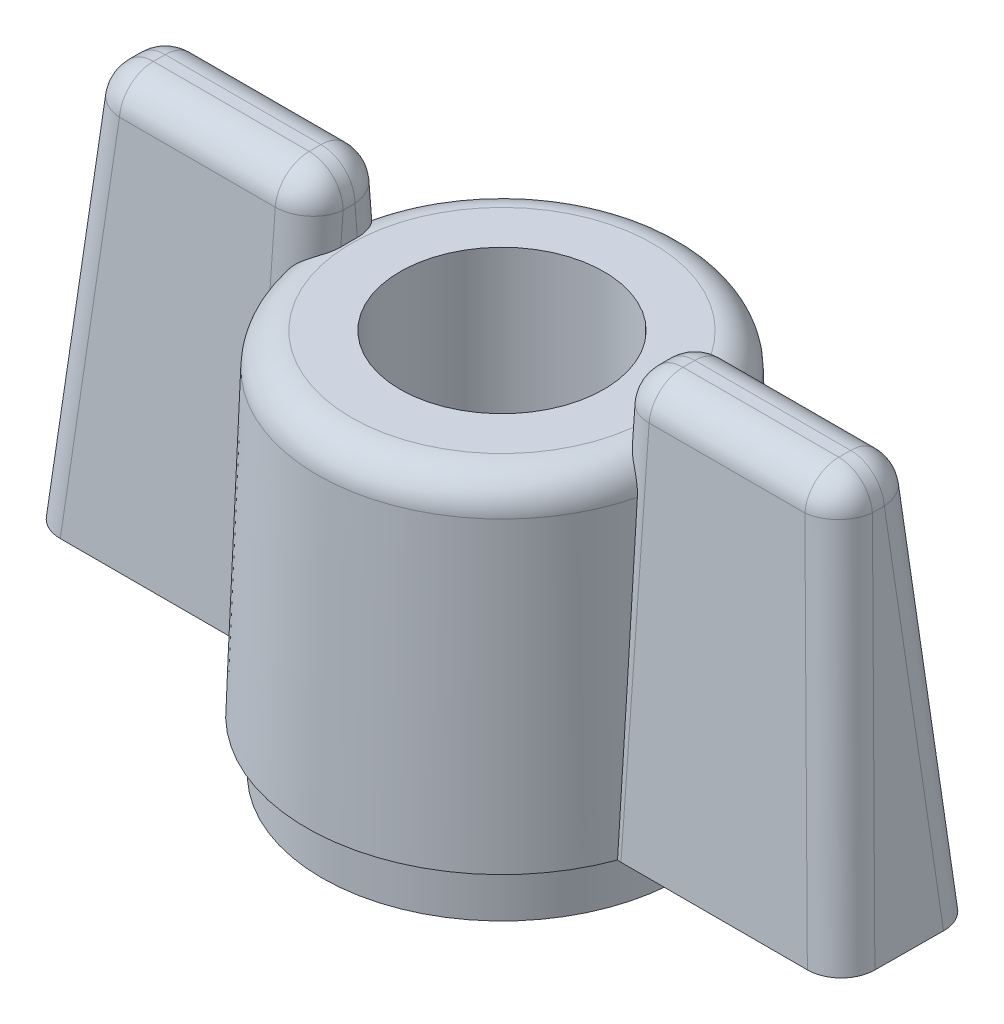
ISO-10303-21;
HEADER;
FILE_DESCRIPTION(('STEP AP214'),'2;1');
FILE_NAME('part.step','',(''),(''),'','','');
FILE_SCHEMA(('AUTOMOTIVE_DESIGN { 1 0 10303 214 1 1 1 1 }'));
ENDSEC;
DATA;
#1=APPLICATION_CONTEXT('core data for automotive mechanical design processes');
#2=APPLICATION_PROTOCOL_DEFINITION('international standard','automotive_design',2000,#1);
#3=PRODUCT_CONTEXT('',#1,'mechanical');
#4=PRODUCT('Part','Part','',(#3));
#5=PRODUCT_RELATED_PRODUCT_CATEGORY('part','',(#4));
#6=PRODUCT_DEFINITION_FORMATION('','',#4);
#7=PRODUCT_DEFINITION_CONTEXT('part definition',#1,'design');
#8=PRODUCT_DEFINITION('design','',#6,#7);
#9=PRODUCT_DEFINITION_SHAPE('','',#8);
#10=(LENGTH_UNIT() NAMED_UNIT(*) SI_UNIT(.MILLI.,.METRE.));
#11=(NAMED_UNIT(*) PLANE_ANGLE_UNIT() SI_UNIT($,.RADIAN.));
#12=(NAMED_UNIT(*) SI_UNIT($,.STERADIAN.) SOLID_ANGLE_UNIT());
#13=UNCERTAINTY_MEASURE_WITH_UNIT(LENGTH_MEASURE(1.E-05),#10,'distance_accuracy_value','');
#14=(GEOMETRIC_REPRESENTATION_CONTEXT(3) GLOBAL_UNCERTAINTY_ASSIGNED_CONTEXT((#13)) GLOBAL_UNIT_ASSIGNED_CONTEXT((#10,
#11,#12)) REPRESENTATION_CONTEXT('',''));
#15=CARTESIAN_POINT('',(0.,0.,0.));
#16=DIRECTION('',(0.,0.,1.));
#17=DIRECTION('',(1.,0.,0.));
#18=AXIS2_PLACEMENT_3D('',#15,#16,#17);
#19=CARTESIAN_POINT('',(0.,10.3356915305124,0.));
#20=DIRECTION('',(0.,-1.,0.));
#21=DIRECTION('',(0.,0.,-1.));
#22=AXIS2_PLACEMENT_3D('',#19,#20,#21);
#23=CONICAL_SURFACE('',#22,5.43443958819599,0.0356991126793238);
#24=CARTESIAN_POINT('',(0.,1.5,0.));
#25=DIRECTION('',(0.,1.,0.));
#26=DIRECTION('',(0.,0.,1.));
#27=AXIS2_PLACEMENT_3D('',#24,#25,#26);
#28=CIRCLE('',#27,5.75);
#29=CARTESIAN_POINT('',(5.39309357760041,1.5,-1.99425215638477));
#30=VERTEX_POINT('',#29);
#31=CARTESIAN_POINT('',(-5.39309357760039,1.5,-1.99425215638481));
#32=VERTEX_POINT('',#31);
#33=EDGE_CURVE('E467',#30,#32,#28,.T.);
#34=ORIENTED_EDGE('',*,*,#33,.T.);
#35=CARTESIAN_POINT('',(-5.39309357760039,1.5,-1.99425215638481));
#36=CARTESIAN_POINT('',(-5.39001527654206,1.83231230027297,-1.96835808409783));
#37=CARTESIAN_POINT('',(-5.38679770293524,2.16462094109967,-1.94243427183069));
#38=CARTESIAN_POINT('',(-5.38008338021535,2.82922957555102,-1.89051976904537));
#39=CARTESIAN_POINT('',(-5.37658663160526,3.16152956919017,-1.86452907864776));
#40=CARTESIAN_POINT('',(-5.360468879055,4.63427175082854,-1.74917290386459));
#41=CARTESIAN_POINT('',(-5.34633983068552,5.77466663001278,-1.65940661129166));
#42=CARTESIAN_POINT('',(-5.31466978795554,8.05530657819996,-1.47849506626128));
#43=CARTESIAN_POINT('',(-5.29712877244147,9.19555164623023,-1.38734980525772));
#44=CARTESIAN_POINT('',(-5.27782383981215,10.3356915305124,-1.295264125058));
#45=B_SPLINE_CURVE_WITH_KNOTS('',3,(#35,#36,#37,#38,#39,#40,#41,#42,#43,#44),.UNSPECIFIED.,.F.,
.F.,(4,2,2,2,4),(0.,1.00000136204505,2.00000092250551,5.43202367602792,8.86406770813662),.UNSPECIFIED.);
#46=CARTESIAN_POINT('',(-5.27782383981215,10.3356915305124,-1.295264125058));
#47=VERTEX_POINT('',#46);
#48=EDGE_CURVE('E296',#32,#47,#45,.T.);
#49=ORIENTED_EDGE('',*,*,#48,.T.);
#50=CARTESIAN_POINT('',(0.,10.3356915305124,0.));
#51=DIRECTION('',(0.,1.,0.));
#52=DIRECTION('',(0.,0.,1.));
#53=AXIS2_PLACEMENT_3D('',#50,#51,#52);
#54=CIRCLE('',#53,5.43443958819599);
#55=CARTESIAN_POINT('',(5.27782383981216,10.3356915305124,-1.29526412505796));
#56=VERTEX_POINT('',#55);
#57=EDGE_CURVE('E55',#56,#47,#54,.T.);
#58=ORIENTED_EDGE('',*,*,#57,.F.);
#59=CARTESIAN_POINT('',(5.27782383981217,10.3356915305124,-1.29526412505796));
#60=CARTESIAN_POINT('',(5.2834533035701,10.0034877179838,-1.32210508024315));
#61=CARTESIAN_POINT('',(5.28893025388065,9.6712744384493,-1.34886026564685));
#62=CARTESIAN_POINT('',(5.29958480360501,9.00683143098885,-1.40221752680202));
#63=CARTESIAN_POINT('',(5.3047624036,8.67460170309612,-1.42881960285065));
#64=CARTESIAN_POINT('',(5.32705890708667,7.20211811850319,-1.54642239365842));
#65=CARTESIAN_POINT('',(5.34259519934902,6.06178205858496,-1.63669782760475));
#66=CARTESIAN_POINT('',(5.37032376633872,3.78097612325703,-1.81616385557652));
#67=CARTESIAN_POINT('',(5.38251601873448,2.64050624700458,-1.90535444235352));
#68=CARTESIAN_POINT('',(5.3930935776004,1.5,-1.99425215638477));
#69=B_SPLINE_CURVE_WITH_KNOTS('',3,(#59,#60,#61,#62,#63,#64,#65,#66,#67,#68),.UNSPECIFIED.,.F.,
.F.,(4,2,2,2,4),(0.,1.00000162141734,2.00000130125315,5.43202316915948,8.86406795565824),.UNSPECIFIED.);
#70=EDGE_CURVE('E289',#56,#30,#69,.T.);
#71=ORIENTED_EDGE('',*,*,#70,.T.);
#72=EDGE_LOOP('',(#34,#49,#58,#71));
#73=FACE_BOUND('',#72,.T.);
#74=ADVANCED_FACE('F28',(#73),#23,.T.);
#75=CARTESIAN_POINT('',(-5.27782383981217,10.3356915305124,1.29526412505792));
#76=VERTEX_POINT('',#75);
#77=CARTESIAN_POINT('',(5.27782383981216,10.3356915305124,1.29526412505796));
#78=VERTEX_POINT('',#77);
#79=EDGE_CURVE('E47',#76,#78,#54,.T.);
#80=ORIENTED_EDGE('',*,*,#79,.F.);
#81=CARTESIAN_POINT('',(-5.27782383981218,10.3356915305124,1.29526412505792));
#82=CARTESIAN_POINT('',(-5.28345330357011,10.0034877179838,1.32210508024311));
#83=CARTESIAN_POINT('',(-5.28893025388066,9.6712744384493,1.34886026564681));
#84=CARTESIAN_POINT('',(-5.29958480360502,9.00683143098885,1.40221752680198));
#85=CARTESIAN_POINT('',(-5.30476240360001,8.67460170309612,1.42881960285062));
#86=CARTESIAN_POINT('',(-5.32705890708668,7.20211811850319,1.54642239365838));
#87=CARTESIAN_POINT('',(-5.34259519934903,6.06178205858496,1.63669782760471));
#88=CARTESIAN_POINT('',(-5.37032376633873,3.78097612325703,1.81616385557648));
#89=CARTESIAN_POINT('',(-5.38251601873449,2.64050624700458,1.90535444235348));
#90=CARTESIAN_POINT('',(-5.39309357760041,1.5,1.99425215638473));
#91=B_SPLINE_CURVE_WITH_KNOTS('',3,(#81,#82,#83,#84,#85,#86,#87,#88,#89,#90),.UNSPECIFIED.,.F.,
.F.,(4,2,2,2,4),(0.,1.00000162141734,2.00000130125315,5.43202316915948,8.86406795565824),.UNSPECIFIED.);
#92=CARTESIAN_POINT('',(-5.39309357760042,1.5,1.99425215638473));
#93=VERTEX_POINT('',#92);
#94=EDGE_CURVE('E11',#76,#93,#91,.T.);
#95=ORIENTED_EDGE('',*,*,#94,.T.);
#96=CARTESIAN_POINT('',(5.39309357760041,1.5,1.99425215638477));
#97=VERTEX_POINT('',#96);
#98=EDGE_CURVE('E466',#93,#97,#28,.T.);
#99=ORIENTED_EDGE('',*,*,#98,.T.);
#100=CARTESIAN_POINT('',(5.39309357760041,1.5,1.99425215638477));
#101=CARTESIAN_POINT('',(5.39001527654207,1.83231230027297,1.96835808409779));
#102=CARTESIAN_POINT('',(5.38679770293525,2.16462094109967,1.94243427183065));
#103=CARTESIAN_POINT('',(5.38008338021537,2.82922957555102,1.89051976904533));
#104=CARTESIAN_POINT('',(5.37658663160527,3.16152956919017,1.86452907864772));
#105=CARTESIAN_POINT('',(5.36046887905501,4.63427175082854,1.74917290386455));
#106=CARTESIAN_POINT('',(5.34633983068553,5.77466663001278,1.65940661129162));
#107=CARTESIAN_POINT('',(5.31466978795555,8.05530657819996,1.47849506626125));
#108=CARTESIAN_POINT('',(5.29712877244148,9.19555164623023,1.38734980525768));
#109=CARTESIAN_POINT('',(5.27782383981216,10.3356915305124,1.29526412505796));
#110=B_SPLINE_CURVE_WITH_KNOTS('',3,(#100,#101,#102,#103,#104,#105,#106,#107,#108,#109),
.UNSPECIFIED.,.F.,.F.,(4,2,2,2,4),(0.,1.00000136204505,2.00000092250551,5.43202367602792,
8.86406770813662),.UNSPECIFIED.);
#111=EDGE_CURVE('E260',#97,#78,#110,.T.);
#112=ORIENTED_EDGE('',*,*,#111,.T.);
#113=EDGE_LOOP('',(#80,#95,#99,#112));
#114=FACE_BOUND('',#113,.T.);
#115=ADVANCED_FACE('F279',(#114),#23,.T.);
#116=CARTESIAN_POINT('',(0.,10.3,0.));
#117=DIRECTION('',(0.,1.,0.));
#118=DIRECTION('',(0.,0.,1.));
#119=AXIS2_PLACEMENT_3D('',#116,#117,#118);
#120=TOROIDAL_SURFACE('',#119,4.43507673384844,1.);
#121=CARTESIAN_POINT('',(0.,11.3,0.));
#122=DIRECTION('',(0.,1.,0.));
#123=DIRECTION('',(0.,0.,1.));
#124=AXIS2_PLACEMENT_3D('',#121,#122,#123);
#125=CIRCLE('',#124,4.43507673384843);
#126=CARTESIAN_POINT('',(0.,11.3,4.43507673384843));
#127=VERTEX_POINT('',#126);
#128=EDGE_CURVE('E462',#127,#127,#125,.T.);
#129=ORIENTED_EDGE('',*,*,#128,.F.);
#130=EDGE_LOOP('',(#129));
#131=FACE_BOUND('',#130,.T.);
#132=ORIENTED_EDGE('',*,*,#57,.T.);
#133=CARTESIAN_POINT('',(-5.27782383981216,10.3356915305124,-1.295264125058));
#134=CARTESIAN_POINT('',(-5.27735411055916,10.3636970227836,-1.29299359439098));
#135=CARTESIAN_POINT('',(-5.27572512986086,10.3916617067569,-1.29047849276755));
#136=CARTESIAN_POINT('',(-5.27019000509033,10.4473095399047,-1.28490838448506));
#137=CARTESIAN_POINT('',(-5.2662839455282,10.4749926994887,-1.28185339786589));
#138=CARTESIAN_POINT('',(-5.25623081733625,10.5299077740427,-1.27514916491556));
#139=CARTESIAN_POINT('',(-5.25008145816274,10.5571391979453,-1.27149931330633));
#140=CARTESIAN_POINT('',(-5.23562799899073,10.6109111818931,-1.26350518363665));
#141=CARTESIAN_POINT('',(-5.22732392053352,10.6374517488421,-1.25916091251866));
#142=CARTESIAN_POINT('',(-5.19930602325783,10.7157921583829,-1.24487919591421));
#143=CARTESIAN_POINT('',(-5.17648772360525,10.7663043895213,-1.23369355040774));
#144=CARTESIAN_POINT('',(-5.12387093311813,10.8621120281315,-1.20661139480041));
#145=CARTESIAN_POINT('',(-5.0940780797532,10.9074116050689,-1.1907186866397));
#146=CARTESIAN_POINT('',(-5.03041603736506,10.9899445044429,-1.15323338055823));
#147=CARTESIAN_POINT('',(-4.99670596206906,11.0273879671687,-1.13183738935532));
#148=CARTESIAN_POINT('',(-4.92698094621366,11.0946380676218,-1.08199880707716));
#149=CARTESIAN_POINT('',(-4.89096895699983,11.1244542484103,-1.05356510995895));
#150=CARTESIAN_POINT('',(-4.82384732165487,11.1728568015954,-0.993071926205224));
#151=CARTESIAN_POINT('',(-4.79265587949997,11.1923474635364,-0.961822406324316));
#152=CARTESIAN_POINT('',(-4.73297937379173,11.2252011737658,-0.893991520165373));
#153=CARTESIAN_POINT('',(-4.70449402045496,11.2385648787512,-0.857410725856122));
#154=CARTESIAN_POINT('',(-4.65300029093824,11.2597025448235,-0.781315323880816));
#155=CARTESIAN_POINT('',(-4.62982428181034,11.2676705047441,-0.7419661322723));
#156=CARTESIAN_POINT('',(-4.58864313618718,11.2800441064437,-0.660063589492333));
#157=CARTESIAN_POINT('',(-4.57064537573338,11.2844446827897,-0.617505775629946));
#158=CARTESIAN_POINT('',(-4.54644402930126,11.2896373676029,-0.547392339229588));
#159=CARTESIAN_POINT('',(-4.53838453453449,11.2911679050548,-0.52050967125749));
#160=CARTESIAN_POINT('',(-4.52450625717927,11.293610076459,-0.466132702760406));
#161=CARTESIAN_POINT('',(-4.51868800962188,11.2945215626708,-0.438638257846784));
#162=CARTESIAN_POINT('',(-4.50936418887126,11.2959263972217,-0.383281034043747));
#163=CARTESIAN_POINT('',(-4.50585621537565,11.2964201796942,-0.355418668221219));
#164=CARTESIAN_POINT('',(-4.50117276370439,11.2971169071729,-0.299503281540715));
#165=CARTESIAN_POINT('',(-4.49999659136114,11.2973199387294,-0.271450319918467));
#166=CARTESIAN_POINT('',(-4.5,11.2974405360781,-0.243396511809));
#167=B_SPLINE_CURVE_WITH_KNOTS('',3,(#133,#134,#135,#136,#137,#138,#139,#140,#141,#142,#143,
#144,#145,#146,#147,#148,#149,#150,#151,#152,#153,#154,#155,#156,#157,#158,#159,#160,#161,#162,
#163,#164,#165,#166),.UNSPECIFIED.,.F.,.F.,(4,2,2,2,2,2,2,2,2,2,2,2,2,2,2,2,4),(0.,
0.0842765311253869,0.168549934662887,0.252909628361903,0.337268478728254,0.506005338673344,
0.674606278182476,0.837863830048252,1.00091610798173,1.14494651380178,1.28896147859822,
1.42747597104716,1.56618680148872,1.65041584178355,1.73466497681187,1.81882644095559,
1.90296284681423),.UNSPECIFIED.);
#168=CARTESIAN_POINT('',(-4.5,11.2974405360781,-0.243396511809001));
#169=VERTEX_POINT('',#168);
#170=EDGE_CURVE('E303',#47,#169,#167,.T.);
#171=ORIENTED_EDGE('',*,*,#170,.T.);
#172=CARTESIAN_POINT('',(-4.5,11.2978902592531,0.));
#173=CARTESIAN_POINT('',(-4.5,11.2978905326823,0.0838283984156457));
#174=CARTESIAN_POINT('',(-4.5,11.2977461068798,0.167656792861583));
#175=CARTESIAN_POINT('',(-4.5,11.2970710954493,0.335313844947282));
#176=CARTESIAN_POINT('',(-4.5,11.2965405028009,0.419142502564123));
#177=CARTESIAN_POINT('',(-4.5,11.2948009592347,0.586900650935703));
#178=CARTESIAN_POINT('',(-4.5,11.2935911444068,0.67083013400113));
#179=CARTESIAN_POINT('',(-4.50000000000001,11.2900144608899,0.838663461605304));
#180=CARTESIAN_POINT('',(-4.50000000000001,11.2876476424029,0.922567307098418));
#181=CARTESIAN_POINT('',(-4.50000000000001,11.2811130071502,1.08992993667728));
#182=CARTESIAN_POINT('',(-4.50000000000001,11.2769533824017,1.17338901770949));
#183=CARTESIAN_POINT('',(-4.50000000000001,11.2660060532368,1.3401321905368));
#184=CARTESIAN_POINT('',(-4.50000000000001,11.2592187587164,1.42341630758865));
#185=CARTESIAN_POINT('',(-4.50000000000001,11.2420101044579,1.58942652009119));
#186=CARTESIAN_POINT('',(-4.50000000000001,11.2315972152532,1.67215346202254));
#187=CARTESIAN_POINT('',(-4.50000000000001,11.2058895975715,1.83683018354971));
#188=CARTESIAN_POINT('',(-4.50000000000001,11.1905980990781,1.9187804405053));
#189=CARTESIAN_POINT('',(-4.50000000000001,11.1625210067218,2.04196700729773));
#190=CARTESIAN_POINT('',(-4.50000000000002,11.1520959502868,2.08373892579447));
#191=CARTESIAN_POINT('',(-4.50000000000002,11.1292621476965,2.16674401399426));
#192=CARTESIAN_POINT('',(-4.50000000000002,11.1168527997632,2.20797701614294));
#193=CARTESIAN_POINT('',(-4.50000000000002,11.0762262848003,2.33058417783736));
#194=CARTESIAN_POINT('',(-4.50000000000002,11.0446006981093,2.4109132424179));
#195=CARTESIAN_POINT('',(-4.50000000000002,10.9787831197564,2.54690570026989));
#196=CARTESIAN_POINT('',(-4.50000000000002,10.9471265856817,2.60378361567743));
#197=CARTESIAN_POINT('',(-4.50000000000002,10.8757080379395,2.71226787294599));
#198=CARTESIAN_POINT('',(-4.50000000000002,10.8359627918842,2.76388479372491));
#199=CARTESIAN_POINT('',(-4.50000000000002,10.7628064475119,2.84182378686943));
#200=CARTESIAN_POINT('',(-4.50000000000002,10.7320844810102,2.87065708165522));
#201=CARTESIAN_POINT('',(-4.50000000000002,10.666605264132,2.92333738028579));
#202=CARTESIAN_POINT('',(-4.50000000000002,10.6318536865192,2.94719126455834));
#203=CARTESIAN_POINT('',(-4.50000000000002,10.5650918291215,2.98466254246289));
#204=CARTESIAN_POINT('',(-4.50000000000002,10.5336834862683,2.99934417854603));
#205=CARTESIAN_POINT('',(-4.50000000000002,10.4688518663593,3.02329115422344));
#206=CARTESIAN_POINT('',(-4.50000000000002,10.4354299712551,3.03256016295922));
#207=CARTESIAN_POINT('',(-4.50000000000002,10.3672613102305,3.0449782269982));
#208=CARTESIAN_POINT('',(-4.50000000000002,10.3325083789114,3.04809405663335));
#209=CARTESIAN_POINT('',(-4.50000000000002,10.2630291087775,3.04781671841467));
#210=CARTESIAN_POINT('',(-4.50000000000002,10.2283027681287,3.04442404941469));
#211=CARTESIAN_POINT('',(-4.50000000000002,10.1629889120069,3.03200627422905));
#212=CARTESIAN_POINT('',(-4.50000000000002,10.1323020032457,3.02348966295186));
#213=CARTESIAN_POINT('',(-4.50000000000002,10.0726090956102,3.00186988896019));
#214=CARTESIAN_POINT('',(-4.50000000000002,10.0436034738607,2.98876570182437));
#215=CARTESIAN_POINT('',(-4.50000000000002,9.97669913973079,2.9527705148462));
#216=CARTESIAN_POINT('',(-4.50000000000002,9.9397819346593,2.92805710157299));
#217=CARTESIAN_POINT('',(-4.50000000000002,9.87038484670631,2.87301420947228));
#218=CARTESIAN_POINT('',(-4.50000000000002,9.83791670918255,2.84267034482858));
#219=CARTESIAN_POINT('',(-4.50000000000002,9.76171837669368,2.76129635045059));
#220=CARTESIAN_POINT('',(-4.50000000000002,9.72079337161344,2.70765778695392));
#221=CARTESIAN_POINT('',(-4.50000000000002,9.64757958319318,2.59494601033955));
#222=CARTESIAN_POINT('',(-4.50000000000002,9.61529742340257,2.53586867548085));
#223=CARTESIAN_POINT('',(-4.50000000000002,9.56005643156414,2.41915227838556));
#224=CARTESIAN_POINT('',(-4.50000000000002,9.53656796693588,2.36175832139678));
#225=CARTESIAN_POINT('',(-4.50000000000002,9.49455741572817,2.24515167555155));
#226=CARTESIAN_POINT('',(-4.50000000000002,9.47604020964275,2.18593726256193));
#227=CARTESIAN_POINT('',(-4.50000000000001,9.4430185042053,2.06606005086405));
#228=CARTESIAN_POINT('',(-4.50000000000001,9.42853735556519,2.00539094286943));
#229=CARTESIAN_POINT('',(-4.50000000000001,9.40298347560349,1.88340602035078));
#230=CARTESIAN_POINT('',(-4.50000000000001,9.39190793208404,1.82209078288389));
#231=CARTESIAN_POINT('',(-4.50000000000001,9.37092856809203,1.68900272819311));
#232=CARTESIAN_POINT('',(-4.50000000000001,9.36151016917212,1.61715473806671));
#233=CARTESIAN_POINT('',(-4.50000000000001,9.34556103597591,1.47313275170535));
#234=CARTESIAN_POINT('',(-4.50000000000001,9.33903102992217,1.40095867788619));
#235=CARTESIAN_POINT('',(-4.50000000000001,9.32268182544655,1.18405037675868));
#236=CARTESIAN_POINT('',(-4.50000000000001,9.3161238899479,1.03908041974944));
#237=CARTESIAN_POINT('',(-4.50000000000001,9.30736586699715,0.748355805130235));
#238=CARTESIAN_POINT('',(-4.5,9.30518717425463,0.602600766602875));
#239=CARTESIAN_POINT('',(-4.5,9.30258214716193,0.311179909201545));
#240=CARTESIAN_POINT('',(-4.5,9.30215457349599,0.165514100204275));
#241=CARTESIAN_POINT('',(-4.5,9.30207050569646,-0.126164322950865));
#242=CARTESIAN_POINT('',(-4.5,9.30241584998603,-0.272176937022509));
#243=CARTESIAN_POINT('',(-4.5,9.30470617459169,-0.564289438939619));
#244=CARTESIAN_POINT('',(-4.5,9.30665223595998,-0.710389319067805));
#245=CARTESIAN_POINT('',(-4.49999999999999,9.31467116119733,-1.00183170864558));
#246=CARTESIAN_POINT('',(-4.49999999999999,9.32072441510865,-1.14717452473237));
#247=CARTESIAN_POINT('',(-4.49999999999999,9.3360295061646,-1.36469967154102));
#248=CARTESIAN_POINT('',(-4.49999999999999,9.34216422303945,-1.43709129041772));
#249=CARTESIAN_POINT('',(-4.49999999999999,9.35721245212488,-1.58157922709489));
#250=CARTESIAN_POINT('',(-4.49999999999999,9.36612537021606,-1.65367560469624));
#251=CARTESIAN_POINT('',(-4.49999999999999,9.38761963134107,-1.797852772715));
#252=CARTESIAN_POINT('',(-4.49999999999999,9.40022629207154,-1.86992989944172));
#253=CARTESIAN_POINT('',(-4.49999999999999,9.4301147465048,-2.01322346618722));
#254=CARTESIAN_POINT('',(-4.49999999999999,9.44740198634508,-2.08443880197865));
#255=CARTESIAN_POINT('',(-4.49999999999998,9.48772159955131,-2.22465072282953));
#256=CARTESIAN_POINT('',(-4.49999999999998,9.51070694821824,-2.29366049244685));
#257=CARTESIAN_POINT('',(-4.49999999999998,9.56394760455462,-2.42876033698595));
#258=CARTESIAN_POINT('',(-4.49999999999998,9.59418961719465,-2.49485549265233));
#259=CARTESIAN_POINT('',(-4.49999999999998,9.6641890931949,-2.62306600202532));
#260=CARTESIAN_POINT('',(-4.49999999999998,9.70406704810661,-2.68511720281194));
#261=CARTESIAN_POINT('',(-4.49999999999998,9.79512114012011,-2.80036392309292));
#262=CARTESIAN_POINT('',(-4.49999999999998,9.8462382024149,-2.85360328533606));
#263=CARTESIAN_POINT('',(-4.49999999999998,9.93142251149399,-2.92154758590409));
#264=CARTESIAN_POINT('',(-4.49999999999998,9.9608718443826,-2.9420495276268));
#265=CARTESIAN_POINT('',(-4.49999999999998,10.0225374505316,-2.97840789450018));
#266=CARTESIAN_POINT('',(-4.49999999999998,10.0547519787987,-2.99426722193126));
#267=CARTESIAN_POINT('',(-4.49999999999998,10.121726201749,-3.02039976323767));
#268=CARTESIAN_POINT('',(-4.49999999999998,10.1565051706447,-3.0306244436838));
#269=CARTESIAN_POINT('',(-4.49999999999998,10.2273669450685,-3.04438574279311));
#270=CARTESIAN_POINT('',(-4.49999999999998,10.2634487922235,-3.04792717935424));
#271=CARTESIAN_POINT('',(-4.49999999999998,10.3323776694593,-3.04798917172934));
#272=CARTESIAN_POINT('',(-4.49999999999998,10.365225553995,-3.04510900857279));
#273=CARTESIAN_POINT('',(-4.49999999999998,10.4299374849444,-3.03377393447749));
#274=CARTESIAN_POINT('',(-4.49999999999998,10.4618013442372,-3.02531797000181));
#275=CARTESIAN_POINT('',(-4.49999999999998,10.5233321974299,-3.00359981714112));
#276=CARTESIAN_POINT('',(-4.49999999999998,10.5530231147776,-2.99040432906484));
#277=CARTESIAN_POINT('',(-4.49999999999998,10.6102294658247,-2.95996336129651));
#278=CARTESIAN_POINT('',(-4.49999999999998,10.6377439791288,-2.94271618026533));
#279=CARTESIAN_POINT('',(-4.49999999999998,10.7056131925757,-2.89402078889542));
#280=CARTESIAN_POINT('',(-4.49999999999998,10.7442110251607,-2.8601222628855));
#281=CARTESIAN_POINT('',(-4.49999999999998,10.8155897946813,-2.78667884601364));
#282=CARTESIAN_POINT('',(-4.49999999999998,10.8483551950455,-2.74711936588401));
#283=CARTESIAN_POINT('',(-4.49999999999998,10.9273441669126,-2.63842225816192));
#284=CARTESIAN_POINT('',(-4.49999999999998,10.9692700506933,-2.566186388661));
#285=CARTESIAN_POINT('',(-4.49999999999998,11.0420953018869,-2.41645143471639));
#286=CARTESIAN_POINT('',(-4.49999999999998,11.0729688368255,-2.33894051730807));
#287=CARTESIAN_POINT('',(-4.49999999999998,11.1350284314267,-2.15486136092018));
#288=CARTESIAN_POINT('',(-4.49999999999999,11.162904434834,-2.04720166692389));
#289=CARTESIAN_POINT('',(-4.49999999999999,11.2080728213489,-1.82961675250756));
#290=CARTESIAN_POINT('',(-4.49999999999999,11.2253411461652,-1.71968696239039));
#291=CARTESIAN_POINT('',(-4.49999999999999,11.252626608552,-1.49851328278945));
#292=CARTESIAN_POINT('',(-4.49999999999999,11.2626129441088,-1.38726581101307));
#293=CARTESIAN_POINT('',(-4.49999999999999,11.2777833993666,-1.16457520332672));
#294=CARTESIAN_POINT('',(-4.49999999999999,11.2829716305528,-1.05313231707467));
#295=CARTESIAN_POINT('',(-4.49999999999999,11.2893698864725,-0.863171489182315));
#296=CARTESIAN_POINT('',(-4.49999999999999,11.291302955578,-0.784674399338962));
#297=CARTESIAN_POINT('',(-4.5,11.2942461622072,-0.627662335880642));
#298=CARTESIAN_POINT('',(-4.5,11.2952562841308,-0.549147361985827));
#299=CARTESIAN_POINT('',(-4.5,11.2967226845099,-0.392184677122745));
#300=CARTESIAN_POINT('',(-4.5,11.2971794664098,-0.313736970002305));
#301=CARTESIAN_POINT('',(-4.5,11.2977630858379,-0.156859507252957));
#302=CARTESIAN_POINT('',(-4.5,11.297890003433,-0.0784297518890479));
#303=CARTESIAN_POINT('',(-4.5,11.2978902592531,0.));
#304=B_SPLINE_CURVE_WITH_KNOTS('',3,(#172,#173,#174,#175,#176,#177,#178,#179,#180,#181,#182,
#183,#184,#185,#186,#187,#188,#189,#190,#191,#192,#193,#194,#195,#196,#197,#198,#199,#200,#201,
#202,#203,#204,#205,#206,#207,#208,#209,#210,#211,#212,#213,#214,#215,#216,#217,#218,#219,#220,
#221,#222,#223,#224,#225,#226,#227,#228,#229,#230,#231,#232,#233,#234,#235,#236,#237,#238,#239,
#240,#241,#242,#243,#244,#245,#246,#247,#248,#249,#250,#251,#252,#253,#254,#255,#256,#257,#258,
#259,#260,#261,#262,#263,#264,#265,#266,#267,#268,#269,#270,#271,#272,#273,#274,#275,#276,#277,
#278,#279,#280,#281,#282,#283,#284,#285,#286,#287,#288,#289,#290,#291,#292,#293,#294,#295,#296,
#297,#298,#299,#300,#301,#302,#303),.UNSPECIFIED.,.T.,.F.,(4,2,2,2,2,2,2,2,2,2,2,2,2,2,2,2,2,2,
2,2,2,2,2,2,2,2,2,2,2,2,2,2,2,2,2,2,2,2,2,2,2,2,2,2,2,2,2,2,2,2,2,2,2,2,2,2,2,2,2,2,2,2,2,2,2,
4),(0.,0.25148501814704,0.502974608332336,0.754784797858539,1.0065840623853,1.25724475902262,
1.50786637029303,1.7579063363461,2.00778110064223,2.13689403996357,2.26604621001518,
2.52420774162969,2.71900027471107,2.91339304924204,3.03941206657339,3.16525578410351,
3.26884604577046,3.37236600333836,3.47644343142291,3.58051288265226,3.67564888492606,
3.77080614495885,3.90333694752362,4.03621114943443,4.2374783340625,4.43889932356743,
4.62466490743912,4.81061220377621,4.99761396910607,5.18446089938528,5.40177030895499,
5.61913447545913,6.05431709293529,6.4916206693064,6.92861470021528,7.36664924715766,
7.80497986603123,8.24123224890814,8.45914560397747,8.67701239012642,8.89640888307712,
9.11606176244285,9.33395897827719,9.55145998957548,9.77183593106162,9.9910801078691,
10.098398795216,10.2056502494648,10.313811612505,10.4218949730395,10.5203170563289,
10.6187577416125,10.715864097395,10.8130113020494,10.96623953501,11.119870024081,
11.3690151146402,11.6187387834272,11.9515043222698,12.2850218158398,12.6199419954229,
12.9545749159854,13.1901316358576,13.4256923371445,13.6610385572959,13.8963276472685),.UNSPECIFIED.);
#305=CARTESIAN_POINT('',(-4.5,11.2974405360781,0.243396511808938));
#306=VERTEX_POINT('',#305);
#307=EDGE_CURVE('E342',#169,#306,#304,.T.);
#308=ORIENTED_EDGE('',*,*,#307,.T.);
#309=CARTESIAN_POINT('',(-4.5,11.2974405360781,0.243396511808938));
#310=CARTESIAN_POINT('',(-4.49999705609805,11.2973232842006,0.270845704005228));
#311=CARTESIAN_POINT('',(-4.50112282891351,11.2971261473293,0.298293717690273));
#312=CARTESIAN_POINT('',(-4.50560618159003,11.2964560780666,0.353006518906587));
#313=CARTESIAN_POINT('',(-4.50896401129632,11.2959831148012,0.380271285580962));
#314=CARTESIAN_POINT('',(-4.51790221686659,11.2946428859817,0.434529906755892));
#315=CARTESIAN_POINT('',(-4.52349070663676,11.2937741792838,0.46152239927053));
#316=CARTESIAN_POINT('',(-4.53682810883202,11.2914538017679,0.514933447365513));
#317=CARTESIAN_POINT('',(-4.54457693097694,11.2900021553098,0.54135202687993));
#318=CARTESIAN_POINT('',(-4.57100388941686,11.2844280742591,0.619594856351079));
#319=CARTESIAN_POINT('',(-4.59284786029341,11.2790872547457,0.670318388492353));
#320=CARTESIAN_POINT('',(-4.64375069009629,11.2630507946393,0.766937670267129));
#321=CARTESIAN_POINT('',(-4.67279028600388,11.2523693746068,0.812845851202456));
#322=CARTESIAN_POINT('',(-4.73389895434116,11.2246931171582,0.895454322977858));
#323=CARTESIAN_POINT('',(-4.76562150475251,11.2081839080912,0.932571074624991));
#324=CARTESIAN_POINT('',(-4.83122942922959,11.1679443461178,1.00045157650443));
#325=CARTESIAN_POINT('',(-4.86511463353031,11.1442145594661,1.03121582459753));
#326=CARTESIAN_POINT('',(-4.92894356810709,11.0923928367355,1.08338189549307));
#327=CARTESIAN_POINT('',(-4.95893685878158,11.0649925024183,1.1054185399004));
#328=CARTESIAN_POINT('',(-5.0167849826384,11.0049715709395,1.14463255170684));
#329=CARTESIAN_POINT('',(-5.044639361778,10.9723498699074,1.16180888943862));
#330=CARTESIAN_POINT('',(-5.09809395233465,10.9009611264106,1.19278536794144));
#331=CARTESIAN_POINT('',(-5.12351454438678,10.8619699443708,1.20637651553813));
#332=CARTESIAN_POINT('',(-5.16927810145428,10.7801021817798,1.23002690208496));
#333=CARTESIAN_POINT('',(-5.18961647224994,10.7372221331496,1.24008294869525));
#334=CARTESIAN_POINT('',(-5.22637240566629,10.6434681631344,1.25859482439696));
#335=CARTESIAN_POINT('',(-5.24206038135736,10.5922441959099,1.26672921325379));
#336=CARTESIAN_POINT('',(-5.26524906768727,10.4877509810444,1.28068410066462));
#337=CARTESIAN_POINT('',(-5.27276517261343,10.4344857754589,1.28650893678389));
#338=CARTESIAN_POINT('',(-5.27698002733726,10.3658698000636,1.29274755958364));
#339=CARTESIAN_POINT('',(-5.27757091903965,10.3507833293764,1.29404154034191));
#340=CARTESIAN_POINT('',(-5.2778238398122,10.3356915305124,1.29526412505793));
#341=B_SPLINE_CURVE_WITH_KNOTS('',3,(#309,#310,#311,#312,#313,#314,#315,#316,#317,#318,#319,
#320,#321,#322,#323,#324,#325,#326,#327,#328,#329,#330,#331,#332,#333,#334,#335,#336,#337,#338,
#339,#340),.UNSPECIFIED.,.F.,.F.,(4,2,2,2,2,2,2,2,2,2,2,2,2,2,2,4),(0.,0.0823234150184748,
0.164656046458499,0.247290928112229,0.329922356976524,0.495448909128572,0.660537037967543,
0.814252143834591,0.967955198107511,1.10598425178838,1.24404252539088,1.38892883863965,
1.53394565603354,1.69580288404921,1.85735467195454,1.90279775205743),.UNSPECIFIED.);
#342=EDGE_CURVE('E41',#306,#76,#341,.T.);
#343=ORIENTED_EDGE('',*,*,#342,.T.);
#344=ORIENTED_EDGE('',*,*,#79,.T.);
#345=CARTESIAN_POINT('',(5.27782383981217,10.3356915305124,1.29526412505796));
#346=CARTESIAN_POINT('',(5.27735411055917,10.3636970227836,1.29299359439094));
#347=CARTESIAN_POINT('',(5.27572512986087,10.3916617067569,1.29047849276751));
#348=CARTESIAN_POINT('',(5.27019000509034,10.4473095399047,1.28490838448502));
#349=CARTESIAN_POINT('',(5.26628394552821,10.4749926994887,1.28185339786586));
#350=CARTESIAN_POINT('',(5.25623081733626,10.5299077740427,1.27514916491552));
#351=CARTESIAN_POINT('',(5.25008145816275,10.5571391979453,1.27149931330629));
#352=CARTESIAN_POINT('',(5.23562799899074,10.6109111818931,1.26350518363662));
#353=CARTESIAN_POINT('',(5.22732392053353,10.6374517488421,1.25916091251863));
#354=CARTESIAN_POINT('',(5.19930602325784,10.7157921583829,1.24487919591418));
#355=CARTESIAN_POINT('',(5.17648772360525,10.7663043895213,1.23369355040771));
#356=CARTESIAN_POINT('',(5.12387093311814,10.8621120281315,1.20661139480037));
#357=CARTESIAN_POINT('',(5.09407807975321,10.9074116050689,1.19071868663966));
#358=CARTESIAN_POINT('',(5.03041603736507,10.9899445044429,1.1532333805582));
#359=CARTESIAN_POINT('',(4.99670596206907,11.0273879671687,1.13183738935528));
#360=CARTESIAN_POINT('',(4.92698094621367,11.0946380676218,1.08199880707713));
#361=CARTESIAN_POINT('',(4.89096895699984,11.1244542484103,1.05356510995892));
#362=CARTESIAN_POINT('',(4.82384732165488,11.1728568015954,0.993071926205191));
#363=CARTESIAN_POINT('',(4.79265587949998,11.1923474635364,0.961822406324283));
#364=CARTESIAN_POINT('',(4.73297937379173,11.2252011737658,0.89399152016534));
#365=CARTESIAN_POINT('',(4.70449402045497,11.2385648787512,0.857410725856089));
#366=CARTESIAN_POINT('',(4.65300029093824,11.2597025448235,0.781315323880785));
#367=CARTESIAN_POINT('',(4.62982428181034,11.2676705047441,0.741966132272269));
#368=CARTESIAN_POINT('',(4.58864313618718,11.2800441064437,0.660063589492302));
#369=CARTESIAN_POINT('',(4.57064537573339,11.2844446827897,0.617505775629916));
#370=CARTESIAN_POINT('',(4.54644402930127,11.2896373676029,0.547392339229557));
#371=CARTESIAN_POINT('',(4.53838453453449,11.2911679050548,0.52050967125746));
#372=CARTESIAN_POINT('',(4.52450625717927,11.293610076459,0.466132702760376));
#373=CARTESIAN_POINT('',(4.51868800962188,11.2945215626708,0.438638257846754));
#374=CARTESIAN_POINT('',(4.50936418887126,11.2959263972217,0.383281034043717));
#375=CARTESIAN_POINT('',(4.50585621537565,11.2964201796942,0.355418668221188));
#376=CARTESIAN_POINT('',(4.50117276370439,11.2971169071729,0.299503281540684));
#377=CARTESIAN_POINT('',(4.49999659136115,11.2973199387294,0.271450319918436));
#378=CARTESIAN_POINT('',(4.5,11.2974405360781,0.243396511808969));
#379=B_SPLINE_CURVE_WITH_KNOTS('',3,(#345,#346,#347,#348,#349,#350,#351,#352,#353,#354,#355,
#356,#357,#358,#359,#360,#361,#362,#363,#364,#365,#366,#367,#368,#369,#370,#371,#372,#373,#374,
#375,#376,#377,#378),.UNSPECIFIED.,.F.,.F.,(4,2,2,2,2,2,2,2,2,2,2,2,2,2,2,2,4),(0.,
0.0842765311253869,0.168549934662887,0.252909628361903,0.337268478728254,0.506005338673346,
0.674606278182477,0.837863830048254,1.00091610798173,1.14494651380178,1.28896147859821,
1.42747597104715,1.56618680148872,1.65041584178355,1.73466497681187,1.81882644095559,
1.90296284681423),.UNSPECIFIED.);
#380=CARTESIAN_POINT('',(4.5,11.2974405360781,0.243396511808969));
#381=VERTEX_POINT('',#380);
#382=EDGE_CURVE('E266',#78,#381,#379,.T.);
#383=ORIENTED_EDGE('',*,*,#382,.T.);
#384=CARTESIAN_POINT('',(4.5,11.2978902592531,0.));
#385=CARTESIAN_POINT('',(4.5,11.2978905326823,-0.0838283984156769));
#386=CARTESIAN_POINT('',(4.5,11.2977461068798,-0.167656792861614));
#387=CARTESIAN_POINT('',(4.5,11.2970710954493,-0.335313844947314));
#388=CARTESIAN_POINT('',(4.5,11.2965405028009,-0.419142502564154));
#389=CARTESIAN_POINT('',(4.5,11.2948009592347,-0.586900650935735));
#390=CARTESIAN_POINT('',(4.5,11.2935911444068,-0.670830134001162));
#391=CARTESIAN_POINT('',(4.5,11.2900144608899,-0.838663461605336));
#392=CARTESIAN_POINT('',(4.5,11.2876476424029,-0.92256730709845));
#393=CARTESIAN_POINT('',(4.5,11.2811130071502,-1.08992993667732));
#394=CARTESIAN_POINT('',(4.5,11.2769533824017,-1.17338901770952));
#395=CARTESIAN_POINT('',(4.5,11.2660060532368,-1.34013219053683));
#396=CARTESIAN_POINT('',(4.5,11.2592187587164,-1.42341630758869));
#397=CARTESIAN_POINT('',(4.5,11.2420101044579,-1.58942652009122));
#398=CARTESIAN_POINT('',(4.5,11.2315972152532,-1.67215346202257));
#399=CARTESIAN_POINT('',(4.5,11.2058895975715,-1.83683018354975));
#400=CARTESIAN_POINT('',(4.5,11.1905980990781,-1.91878044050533));
#401=CARTESIAN_POINT('',(4.5,11.1625210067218,-2.04196700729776));
#402=CARTESIAN_POINT('',(4.5,11.1520959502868,-2.0837389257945));
#403=CARTESIAN_POINT('',(4.5,11.1292621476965,-2.16674401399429));
#404=CARTESIAN_POINT('',(4.5,11.1168527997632,-2.20797701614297));
#405=CARTESIAN_POINT('',(4.5,11.0762262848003,-2.33058417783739));
#406=CARTESIAN_POINT('',(4.5,11.0446006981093,-2.41091324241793));
#407=CARTESIAN_POINT('',(4.5,10.9787831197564,-2.54690570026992));
#408=CARTESIAN_POINT('',(4.5,10.9471265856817,-2.60378361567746));
#409=CARTESIAN_POINT('',(4.5,10.8757080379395,-2.71226787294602));
#410=CARTESIAN_POINT('',(4.5,10.8359627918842,-2.76388479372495));
#411=CARTESIAN_POINT('',(4.5,10.7628064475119,-2.84182378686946));
#412=CARTESIAN_POINT('',(4.5,10.7320844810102,-2.87065708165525));
#413=CARTESIAN_POINT('',(4.5,10.666605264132,-2.92333738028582));
#414=CARTESIAN_POINT('',(4.5,10.6318536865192,-2.94719126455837));
#415=CARTESIAN_POINT('',(4.5,10.5650918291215,-2.98466254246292));
#416=CARTESIAN_POINT('',(4.5,10.5336834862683,-2.99934417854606));
#417=CARTESIAN_POINT('',(4.5,10.4688518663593,-3.02329115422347));
#418=CARTESIAN_POINT('',(4.5,10.4354299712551,-3.03256016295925));
#419=CARTESIAN_POINT('',(4.5,10.3672613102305,-3.04497822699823));
#420=CARTESIAN_POINT('',(4.5,10.3325083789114,-3.04809405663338));
#421=CARTESIAN_POINT('',(4.5,10.2630291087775,-3.04781671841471));
#422=CARTESIAN_POINT('',(4.5,10.2283027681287,-3.04442404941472));
#423=CARTESIAN_POINT('',(4.5,10.1629889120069,-3.03200627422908));
#424=CARTESIAN_POINT('',(4.5,10.1323020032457,-3.02348966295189));
#425=CARTESIAN_POINT('',(4.5,10.0726090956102,-3.00186988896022));
#426=CARTESIAN_POINT('',(4.5,10.0436034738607,-2.9887657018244));
#427=CARTESIAN_POINT('',(4.5,9.97669913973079,-2.95277051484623));
#428=CARTESIAN_POINT('',(4.5,9.9397819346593,-2.92805710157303));
#429=CARTESIAN_POINT('',(4.5,9.87038484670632,-2.87301420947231));
#430=CARTESIAN_POINT('',(4.5,9.83791670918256,-2.84267034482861));
#431=CARTESIAN_POINT('',(4.5,9.76171837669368,-2.76129635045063));
#432=CARTESIAN_POINT('',(4.5,9.72079337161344,-2.70765778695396));
#433=CARTESIAN_POINT('',(4.5,9.64757958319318,-2.5949460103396));
#434=CARTESIAN_POINT('',(4.5,9.61529742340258,-2.53586867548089));
#435=CARTESIAN_POINT('',(4.5,9.56005643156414,-2.4191522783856));
#436=CARTESIAN_POINT('',(4.5,9.53656796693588,-2.36175832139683));
#437=CARTESIAN_POINT('',(4.5,9.49455741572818,-2.2451516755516));
#438=CARTESIAN_POINT('',(4.5,9.47604020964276,-2.18593726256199));
#439=CARTESIAN_POINT('',(4.5,9.44301850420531,-2.06606005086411));
#440=CARTESIAN_POINT('',(4.5,9.4285373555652,-2.00539094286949));
#441=CARTESIAN_POINT('',(4.5,9.4029834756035,-1.88340602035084));
#442=CARTESIAN_POINT('',(4.5,9.39190793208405,-1.82209078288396));
#443=CARTESIAN_POINT('',(4.5,9.37092856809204,-1.68900272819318));
#444=CARTESIAN_POINT('',(4.5,9.36151016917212,-1.61715473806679));
#445=CARTESIAN_POINT('',(4.5,9.34556103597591,-1.47313275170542));
#446=CARTESIAN_POINT('',(4.5,9.33903102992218,-1.40095867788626));
#447=CARTESIAN_POINT('',(4.5,9.32268182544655,-1.18405037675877));
#448=CARTESIAN_POINT('',(4.5,9.3161238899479,-1.03908041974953));
#449=CARTESIAN_POINT('',(4.5,9.30736586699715,-0.748355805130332));
#450=CARTESIAN_POINT('',(4.5,9.30518717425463,-0.602600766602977));
#451=CARTESIAN_POINT('',(4.5,9.30258214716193,-0.311179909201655));
#452=CARTESIAN_POINT('',(4.5,9.30215457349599,-0.16551410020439));
#453=CARTESIAN_POINT('',(4.5,9.30207050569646,0.126164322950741));
#454=CARTESIAN_POINT('',(4.5,9.30241584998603,0.272176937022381));
#455=CARTESIAN_POINT('',(4.5,9.30470617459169,0.564289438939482));
#456=CARTESIAN_POINT('',(4.5,9.30665223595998,0.710389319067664));
#457=CARTESIAN_POINT('',(4.5,9.31467116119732,1.00183170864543));
#458=CARTESIAN_POINT('',(4.5,9.32072441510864,1.14717452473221));
#459=CARTESIAN_POINT('',(4.5,9.33602950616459,1.36469967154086));
#460=CARTESIAN_POINT('',(4.5,9.34216422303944,1.43709129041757));
#461=CARTESIAN_POINT('',(4.5,9.35721245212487,1.58157922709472));
#462=CARTESIAN_POINT('',(4.5,9.36612537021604,1.65367560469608));
#463=CARTESIAN_POINT('',(4.5,9.38761963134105,1.79785277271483));
#464=CARTESIAN_POINT('',(4.5,9.40022629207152,1.86992989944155));
#465=CARTESIAN_POINT('',(4.5,9.43011474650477,2.01322346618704));
#466=CARTESIAN_POINT('',(4.5,9.44740198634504,2.08443880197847));
#467=CARTESIAN_POINT('',(4.5,9.48772159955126,2.22465072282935));
#468=CARTESIAN_POINT('',(4.5,9.51070694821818,2.29366049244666));
#469=CARTESIAN_POINT('',(4.5,9.56394760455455,2.42876033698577));
#470=CARTESIAN_POINT('',(4.5,9.59418961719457,2.49485549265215));
#471=CARTESIAN_POINT('',(4.5,9.66418909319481,2.62306600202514));
#472=CARTESIAN_POINT('',(4.5,9.70406704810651,2.68511720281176));
#473=CARTESIAN_POINT('',(4.5,9.79512114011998,2.80036392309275));
#474=CARTESIAN_POINT('',(4.5,9.84623820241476,2.8536032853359));
#475=CARTESIAN_POINT('',(4.5,9.93142251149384,2.92154758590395));
#476=CARTESIAN_POINT('',(4.5,9.96087184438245,2.94204952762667));
#477=CARTESIAN_POINT('',(4.5,10.0225374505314,2.97840789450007));
#478=CARTESIAN_POINT('',(4.5,10.0547519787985,2.99426722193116));
#479=CARTESIAN_POINT('',(4.5,10.1217262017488,3.02039976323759));
#480=CARTESIAN_POINT('',(4.5,10.1565051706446,3.03062444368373));
#481=CARTESIAN_POINT('',(4.5,10.2273669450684,3.04438574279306));
#482=CARTESIAN_POINT('',(4.5,10.2634487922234,3.04792717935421));
#483=CARTESIAN_POINT('',(4.5,10.3323776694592,3.04798917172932));
#484=CARTESIAN_POINT('',(4.5,10.3652255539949,3.04510900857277));
#485=CARTESIAN_POINT('',(4.5,10.4299374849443,3.03377393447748));
#486=CARTESIAN_POINT('',(4.5,10.4618013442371,3.02531797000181));
#487=CARTESIAN_POINT('',(4.5,10.5233321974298,3.00359981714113));
#488=CARTESIAN_POINT('',(4.5,10.5530231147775,2.99040432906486));
#489=CARTESIAN_POINT('',(4.5,10.6102294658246,2.95996336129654));
#490=CARTESIAN_POINT('',(4.5,10.6377439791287,2.94271618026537));
#491=CARTESIAN_POINT('',(4.5,10.7056131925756,2.89402078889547));
#492=CARTESIAN_POINT('',(4.5,10.7442110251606,2.86012226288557));
#493=CARTESIAN_POINT('',(4.5,10.8155897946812,2.78667884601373));
#494=CARTESIAN_POINT('',(4.5,10.8483551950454,2.74711936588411));
#495=CARTESIAN_POINT('',(4.5,10.9273441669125,2.63842225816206));
#496=CARTESIAN_POINT('',(4.5,10.9692700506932,2.56618638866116));
#497=CARTESIAN_POINT('',(4.5,11.0420953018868,2.41645143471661));
#498=CARTESIAN_POINT('',(4.5,11.0729688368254,2.33894051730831));
#499=CARTESIAN_POINT('',(4.5,11.1350284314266,2.15486136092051));
#500=CARTESIAN_POINT('',(4.5,11.1629044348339,2.04720166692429));
#501=CARTESIAN_POINT('',(4.5,11.2080728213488,1.82961675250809));
#502=CARTESIAN_POINT('',(4.5,11.2253411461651,1.71968696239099));
#503=CARTESIAN_POINT('',(4.5,11.2526266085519,1.49851328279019));
#504=CARTESIAN_POINT('',(4.5,11.2626129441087,1.38726581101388));
#505=CARTESIAN_POINT('',(4.5,11.2777833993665,1.16457520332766));
#506=CARTESIAN_POINT('',(4.5,11.2829716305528,1.05313231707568));
#507=CARTESIAN_POINT('',(4.5,11.2893698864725,0.863171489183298));
#508=CARTESIAN_POINT('',(4.5,11.291302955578,0.784674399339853));
#509=CARTESIAN_POINT('',(4.5,11.2942461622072,0.627662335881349));
#510=CARTESIAN_POINT('',(4.5,11.2952562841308,0.549147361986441));
#511=CARTESIAN_POINT('',(4.5,11.2967226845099,0.392184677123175));
#512=CARTESIAN_POINT('',(4.5,11.2971794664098,0.313736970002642));
#513=CARTESIAN_POINT('',(4.5,11.2977630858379,0.15685950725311));
#514=CARTESIAN_POINT('',(4.5,11.297890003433,0.0784297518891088));
#515=CARTESIAN_POINT('',(4.5,11.2978902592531,0.));
#516=B_SPLINE_CURVE_WITH_KNOTS('',3,(#384,#385,#386,#387,#388,#389,#390,#391,#392,#393,#394,
#395,#396,#397,#398,#399,#400,#401,#402,#403,#404,#405,#406,#407,#408,#409,#410,#411,#412,#413,
#414,#415,#416,#417,#418,#419,#420,#421,#422,#423,#424,#425,#426,#427,#428,#429,#430,#431,#432,
#433,#434,#435,#436,#437,#438,#439,#440,#441,#442,#443,#444,#445,#446,#447,#448,#449,#450,#451,
#452,#453,#454,#455,#456,#457,#458,#459,#460,#461,#462,#463,#464,#465,#466,#467,#468,#469,#470,
#471,#472,#473,#474,#475,#476,#477,#478,#479,#480,#481,#482,#483,#484,#485,#486,#487,#488,#489,
#490,#491,#492,#493,#494,#495,#496,#497,#498,#499,#500,#501,#502,#503,#504,#505,#506,#507,#508,
#509,#510,#511,#512,#513,#514,#515),.UNSPECIFIED.,.T.,.F.,(4,2,2,2,2,2,2,2,2,2,2,2,2,2,2,2,2,2,
2,2,2,2,2,2,2,2,2,2,2,2,2,2,2,2,2,2,2,2,2,2,2,2,2,2,2,2,2,2,2,2,2,2,2,2,2,2,2,2,2,2,2,2,2,2,2,
4),(0.,0.25148501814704,0.502974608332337,0.75478479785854,1.0065840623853,1.25724475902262,
1.50786637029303,1.7579063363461,2.00778110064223,2.13689403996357,2.26604621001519,
2.52420774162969,2.71900027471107,2.91339304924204,3.03941206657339,3.16525578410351,
3.26884604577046,3.37236600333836,3.47644343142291,3.58051288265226,3.67564888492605,
3.77080614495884,3.90333694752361,4.03621114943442,4.23747833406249,4.43889932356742,
4.62466490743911,4.81061220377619,4.99761396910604,5.18446089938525,5.40177030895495,
5.61913447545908,6.05431709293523,6.49162066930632,6.9286147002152,7.36664924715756,
7.80497986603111,8.24123224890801,8.45914560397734,8.67701239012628,8.89640888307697,
9.11606176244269,9.33395897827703,9.5514599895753,9.77183593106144,9.99108010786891,
10.0983987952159,10.2056502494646,10.3138116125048,10.4218949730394,10.5203170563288,
10.6187577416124,10.7158640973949,10.8130113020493,10.9662395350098,11.1198700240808,
11.36901511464,11.6187387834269,11.9515043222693,12.2850218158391,12.6199419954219,
12.9545749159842,13.1901316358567,13.425692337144,13.6610385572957,13.8963276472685),.UNSPECIFIED.);
#517=CARTESIAN_POINT('',(4.5,11.2974405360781,-0.243396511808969));
#518=VERTEX_POINT('',#517);
#519=EDGE_CURVE('E206',#381,#518,#516,.T.);
#520=ORIENTED_EDGE('',*,*,#519,.T.);
#521=CARTESIAN_POINT('',(4.5,11.2974405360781,-0.243396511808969));
#522=CARTESIAN_POINT('',(4.49999705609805,11.2973232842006,-0.270845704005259));
#523=CARTESIAN_POINT('',(4.50112282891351,11.2971261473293,-0.298293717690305));
#524=CARTESIAN_POINT('',(4.50560618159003,11.2964560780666,-0.353006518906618));
#525=CARTESIAN_POINT('',(4.50896401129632,11.2959831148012,-0.380271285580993));
#526=CARTESIAN_POINT('',(4.51790221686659,11.2946428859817,-0.434529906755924));
#527=CARTESIAN_POINT('',(4.52349070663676,11.2937741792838,-0.461522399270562));
#528=CARTESIAN_POINT('',(4.53682810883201,11.2914538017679,-0.514933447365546));
#529=CARTESIAN_POINT('',(4.54457693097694,11.2900021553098,-0.541352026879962));
#530=CARTESIAN_POINT('',(4.57100388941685,11.2844280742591,-0.619594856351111));
#531=CARTESIAN_POINT('',(4.59284786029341,11.2790872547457,-0.670318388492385));
#532=CARTESIAN_POINT('',(4.64375069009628,11.2630507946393,-0.766937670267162));
#533=CARTESIAN_POINT('',(4.67279028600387,11.2523693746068,-0.812845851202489));
#534=CARTESIAN_POINT('',(4.73389895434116,11.2246931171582,-0.895454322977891));
#535=CARTESIAN_POINT('',(4.7656215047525,11.2081839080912,-0.932571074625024));
#536=CARTESIAN_POINT('',(4.83122942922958,11.1679443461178,-1.00045157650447));
#537=CARTESIAN_POINT('',(4.86511463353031,11.1442145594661,-1.03121582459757));
#538=CARTESIAN_POINT('',(4.92894356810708,11.0923928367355,-1.0833818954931));
#539=CARTESIAN_POINT('',(4.95893685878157,11.0649925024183,-1.10541853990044));
#540=CARTESIAN_POINT('',(5.01678498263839,11.0049715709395,-1.14463255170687));
#541=CARTESIAN_POINT('',(5.04463936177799,10.9723498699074,-1.16180888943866));
#542=CARTESIAN_POINT('',(5.09809395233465,10.9009611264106,-1.19278536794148));
#543=CARTESIAN_POINT('',(5.12351454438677,10.8619699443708,-1.20637651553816));
#544=CARTESIAN_POINT('',(5.16927810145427,10.7801021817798,-1.230026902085));
#545=CARTESIAN_POINT('',(5.18961647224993,10.7372221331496,-1.24008294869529));
#546=CARTESIAN_POINT('',(5.22637240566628,10.6434681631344,-1.258594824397));
#547=CARTESIAN_POINT('',(5.24206038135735,10.5922441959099,-1.26672921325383));
#548=CARTESIAN_POINT('',(5.26524906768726,10.4877509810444,-1.28068410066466));
#549=CARTESIAN_POINT('',(5.27276517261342,10.4344857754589,-1.28650893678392));
#550=CARTESIAN_POINT('',(5.27698002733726,10.3658698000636,-1.29274755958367));
#551=CARTESIAN_POINT('',(5.27757091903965,10.3507833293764,-1.29404154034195));
#552=CARTESIAN_POINT('',(5.27782383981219,10.3356915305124,-1.29526412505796));
#553=B_SPLINE_CURVE_WITH_KNOTS('',3,(#521,#522,#523,#524,#525,#526,#527,#528,#529,#530,#531,
#532,#533,#534,#535,#536,#537,#538,#539,#540,#541,#542,#543,#544,#545,#546,#547,#548,#549,#550,
#551,#552),.UNSPECIFIED.,.F.,.F.,(4,2,2,2,2,2,2,2,2,2,2,2,2,2,2,4),(0.,0.0823234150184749,
0.1646560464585,0.247290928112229,0.329922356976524,0.495448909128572,0.660537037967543,
0.814252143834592,0.967955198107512,1.10598425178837,1.24404252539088,1.38892883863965,
1.53394565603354,1.69580288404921,1.85735467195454,1.90279775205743),.UNSPECIFIED.);
#554=EDGE_CURVE('E600',#518,#56,#553,.T.);
#555=ORIENTED_EDGE('',*,*,#554,.T.);
#556=EDGE_LOOP('',(#132,#171,#308,#343,#344,#383,#520,#555));
#557=FACE_BOUND('',#556,.T.);
#558=ADVANCED_FACE('F281',(#131,#557),#120,.T.);
#559=CARTESIAN_POINT('',(-4.43507673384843,11.3,0.));
#560=DIRECTION('',(0.,1.,0.));
#561=DIRECTION('',(0.,0.,1.));
#562=AXIS2_PLACEMENT_3D('',#559,#560,#561);
#563=PLANE('',#562);
#564=ORIENTED_EDGE('',*,*,#128,.T.);
#565=EDGE_LOOP('',(#564));
#566=FACE_BOUND('',#565,.T.);
#567=CARTESIAN_POINT('',(0.,11.3,0.));
#568=DIRECTION('',(0.,1.,0.));
#569=DIRECTION('',(0.,0.,1.));
#570=AXIS2_PLACEMENT_3D('',#567,#568,#569);
#571=CIRCLE('',#570,3.);
#572=CARTESIAN_POINT('',(0.,11.3,3.));
#573=VERTEX_POINT('',#572);
#574=EDGE_CURVE('E478',#573,#573,#571,.T.);
#575=ORIENTED_EDGE('',*,*,#574,.F.);
#576=EDGE_LOOP('',(#575));
#577=FACE_BOUND('',#576,.T.);
#578=ADVANCED_FACE('F30',(#566,#577),#563,.T.);
#579=CARTESIAN_POINT('',(0.,51.0351851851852,0.));
#580=DIRECTION('',(0.,1.,0.));
#581=DIRECTION('',(0.,0.,1.));
#582=AXIS2_PLACEMENT_3D('',#579,#580,#581);
#583=CYLINDRICAL_SURFACE('',#582,3.);
#584=ORIENTED_EDGE('',*,*,#574,.T.);
#585=EDGE_LOOP('',(#584));
#586=FACE_BOUND('',#585,.T.);
#587=CARTESIAN_POINT('',(0.,0.,0.));
#588=DIRECTION('',(0.,1.,0.));
#589=DIRECTION('',(0.,0.,1.));
#590=AXIS2_PLACEMENT_3D('',#587,#588,#589);
#591=CIRCLE('',#590,2.99999999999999);
#592=CARTESIAN_POINT('',(0.,0.,2.99999999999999));
#593=VERTEX_POINT('',#592);
#594=EDGE_CURVE('E475',#593,#593,#591,.T.);
#595=ORIENTED_EDGE('',*,*,#594,.F.);
#596=EDGE_LOOP('',(#595));
#597=FACE_BOUND('',#596,.T.);
#598=ADVANCED_FACE('F650',(#586,#597),#583,.F.);
#599=CARTESIAN_POINT('',(-2.99999999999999,0.,0.));
#600=DIRECTION('',(0.,-1.,0.));
#601=DIRECTION('',(0.,0.,-1.));
#602=AXIS2_PLACEMENT_3D('',#599,#600,#601);
#603=PLANE('',#602);
#604=ORIENTED_EDGE('',*,*,#594,.T.);
#605=EDGE_LOOP('',(#604));
#606=FACE_BOUND('',#605,.T.);
#607=CARTESIAN_POINT('',(0.,0.,0.));
#608=DIRECTION('',(0.,1.,0.));
#609=DIRECTION('',(0.,0.,1.));
#610=AXIS2_PLACEMENT_3D('',#607,#608,#609);
#611=CIRCLE('',#610,5.3);
#612=CARTESIAN_POINT('',(0.,0.,5.3));
#613=VERTEX_POINT('',#612);
#614=EDGE_CURVE('E472',#613,#613,#611,.T.);
#615=ORIENTED_EDGE('',*,*,#614,.F.);
#616=EDGE_LOOP('',(#615));
#617=FACE_BOUND('',#616,.T.);
#618=ADVANCED_FACE('F646',(#606,#617),#603,.T.);
#619=CARTESIAN_POINT('',(0.,51.0351851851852,0.));
#620=DIRECTION('',(0.,1.,0.));
#621=DIRECTION('',(0.,0.,1.));
#622=AXIS2_PLACEMENT_3D('',#619,#620,#621);
#623=CYLINDRICAL_SURFACE('',#622,5.3);
#624=ORIENTED_EDGE('',*,*,#614,.T.);
#625=EDGE_LOOP('',(#624));
#626=FACE_BOUND('',#625,.T.);
#627=CARTESIAN_POINT('',(0.,1.5,0.));
#628=DIRECTION('',(0.,1.,0.));
#629=DIRECTION('',(0.,0.,1.));
#630=AXIS2_PLACEMENT_3D('',#627,#628,#629);
#631=CIRCLE('',#630,5.3);
#632=CARTESIAN_POINT('',(0.,1.5,5.3));
#633=VERTEX_POINT('',#632);
#634=EDGE_CURVE('E469',#633,#633,#631,.T.);
#635=ORIENTED_EDGE('',*,*,#634,.F.);
#636=EDGE_LOOP('',(#635));
#637=FACE_BOUND('',#636,.T.);
#638=ADVANCED_FACE('F515',(#626,#637),#623,.T.);
#639=CARTESIAN_POINT('',(-5.3,1.5,0.));
#640=DIRECTION('',(0.,-1.,0.));
#641=DIRECTION('',(0.,0.,-1.));
#642=AXIS2_PLACEMENT_3D('',#639,#640,#641);
#643=PLANE('',#642);
#644=CARTESIAN_POINT('',(-5.49999999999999,1.5,-0.997045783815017));
#645=DIRECTION('',(0.,-1.,0.));
#646=DIRECTION('',(0.,0.,-1.));
#647=AXIS2_PLACEMENT_3D('',#644,#645,#646);
#648=ELLIPSE('',#647,1.00295421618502,1.);
#649=CARTESIAN_POINT('',(-5.49999999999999,1.5,-2.00000000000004));
#650=VERTEX_POINT('',#649);
#651=EDGE_CURVE('E535',#650,#32,#648,.T.);
#652=ORIENTED_EDGE('',*,*,#651,.T.);
#653=ORIENTED_EDGE('',*,*,#33,.F.);
#654=CARTESIAN_POINT('',(5.5,1.5,-0.997045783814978));
#655=DIRECTION('',(0.,-1.,0.));
#656=DIRECTION('',(0.,0.,1.));
#657=AXIS2_PLACEMENT_3D('',#654,#655,#656);
#658=ELLIPSE('',#657,1.00295421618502,1.);
#659=CARTESIAN_POINT('',(5.5,1.5,-2.));
#660=VERTEX_POINT('',#659);
#661=EDGE_CURVE('E241',#30,#660,#658,.T.);
#662=ORIENTED_EDGE('',*,*,#661,.T.);
#663=DIRECTION('',(-1.,0.,0.));
#664=VECTOR('',#663,1.);
#665=CARTESIAN_POINT('',(12.,1.5,-2.));
#666=LINE('',#665,#664);
#667=CARTESIAN_POINT('',(10.9964484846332,1.5,-2.));
#668=VERTEX_POINT('',#667);
#669=EDGE_CURVE('E454',#668,#660,#666,.T.);
#670=ORIENTED_EDGE('',*,*,#669,.F.);
#671=CARTESIAN_POINT('',(10.9899596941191,1.5,-0.997045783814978));
#672=DIRECTION('',(0.,-1.,0.));
#673=DIRECTION('',(-0.739892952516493,0.,0.672724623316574));
#674=AXIS2_PLACEMENT_3D('',#671,#672,#673);
#675=ELLIPSE('',#674,1.00651622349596,1.);
#676=CARTESIAN_POINT('',(11.9935112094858,1.5,-0.997045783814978));
#677=VERTEX_POINT('',#676);
#678=EDGE_CURVE('E217',#668,#677,#675,.T.);
#679=ORIENTED_EDGE('',*,*,#678,.T.);
#680=DIRECTION('',(0.00646954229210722,0.,-0.999979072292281));
#681=VECTOR('',#680,1.);
#682=CARTESIAN_POINT('',(11.9863370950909,1.5,0.111837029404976));
#683=LINE('',#682,#681);
#684=CARTESIAN_POINT('',(11.9805266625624,1.5,1.00993934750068));
#685=VERTEX_POINT('',#684);
#686=EDGE_CURVE('E198',#685,#677,#683,.T.);
#687=ORIENTED_EDGE('',*,*,#686,.F.);
#688=CARTESIAN_POINT('',(10.9770585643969,1.5,0.997045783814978));
#689=DIRECTION('',(0.,-1.,0.));
#690=DIRECTION('',(-0.735915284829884,0.,-0.677073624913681));
#691=AXIS2_PLACEMENT_3D('',#688,#689,#690);
#692=ELLIPSE('',#691,1.0064330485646,1.);
#693=CARTESIAN_POINT('',(10.9834710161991,1.5,2.));
#694=VERTEX_POINT('',#693);
#695=EDGE_CURVE('E213',#685,#694,#692,.T.);
#696=ORIENTED_EDGE('',*,*,#695,.T.);
#697=DIRECTION('',(-1.,0.,0.));
#698=VECTOR('',#697,1.);
#699=CARTESIAN_POINT('',(12.,1.5,2.));
#700=LINE('',#699,#698);
#701=CARTESIAN_POINT('',(5.5,1.5,2.));
#702=VERTEX_POINT('',#701);
#703=EDGE_CURVE('E457',#694,#702,#700,.T.);
#704=ORIENTED_EDGE('',*,*,#703,.T.);
#705=CARTESIAN_POINT('',(5.5,1.5,0.997045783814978));
#706=DIRECTION('',(0.,-1.,0.));
#707=DIRECTION('',(0.,0.,1.));
#708=AXIS2_PLACEMENT_3D('',#705,#706,#707);
#709=ELLIPSE('',#708,1.00295421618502,1.);
#710=EDGE_CURVE('E243',#702,#97,#709,.T.);
#711=ORIENTED_EDGE('',*,*,#710,.T.);
#712=ORIENTED_EDGE('',*,*,#98,.F.);
#713=CARTESIAN_POINT('',(-5.50000000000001,1.5,0.99704578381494));
#714=DIRECTION('',(0.,-1.,0.));
#715=DIRECTION('',(0.,0.,-1.));
#716=AXIS2_PLACEMENT_3D('',#713,#714,#715);
#717=ELLIPSE('',#716,1.00295421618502,1.);
#718=CARTESIAN_POINT('',(-5.50000000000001,1.5,1.99999999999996));
#719=VERTEX_POINT('',#718);
#720=EDGE_CURVE('E534',#93,#719,#717,.T.);
#721=ORIENTED_EDGE('',*,*,#720,.T.);
#722=DIRECTION('',(1.,0.,0.));
#723=VECTOR('',#722,1.);
#724=CARTESIAN_POINT('',(-12.,1.5,1.99999999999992));
#725=LINE('',#724,#723);
#726=CARTESIAN_POINT('',(-10.9964484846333,1.5,1.99999999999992));
#727=VERTEX_POINT('',#726);
#728=EDGE_CURVE('E378',#727,#719,#725,.T.);
#729=ORIENTED_EDGE('',*,*,#728,.F.);
#730=CARTESIAN_POINT('',(-10.9899596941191,1.5,0.997045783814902));
#731=DIRECTION('',(0.,-1.,0.));
#732=DIRECTION('',(0.739892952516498,0.,-0.672724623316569));
#733=AXIS2_PLACEMENT_3D('',#730,#731,#732);
#734=ELLIPSE('',#733,1.00651622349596,1.);
#735=CARTESIAN_POINT('',(-11.9935112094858,1.5,0.997045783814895));
#736=VERTEX_POINT('',#735);
#737=EDGE_CURVE('E548',#727,#736,#734,.T.);
#738=ORIENTED_EDGE('',*,*,#737,.T.);
#739=DIRECTION('',(-0.0064695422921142,0.,0.999979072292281));
#740=VECTOR('',#739,1.);
#741=CARTESIAN_POINT('',(-11.9867807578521,1.5,-0.0432613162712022));
#742=LINE('',#741,#740);
#743=CARTESIAN_POINT('',(-11.9805266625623,1.5,-1.00993934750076));
#744=VERTEX_POINT('',#743);
#745=EDGE_CURVE('E411',#744,#736,#742,.T.);
#746=ORIENTED_EDGE('',*,*,#745,.F.);
#747=CARTESIAN_POINT('',(-10.9770585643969,1.5,-0.997045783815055));
#748=DIRECTION('',(0.,-1.,0.));
#749=DIRECTION('',(0.735915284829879,0.,0.677073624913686));
#750=AXIS2_PLACEMENT_3D('',#747,#748,#749);
#751=ELLIPSE('',#750,1.0064330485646,1.);
#752=CARTESIAN_POINT('',(-10.9834710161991,1.5,-2.00000000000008));
#753=VERTEX_POINT('',#752);
#754=EDGE_CURVE('E550',#744,#753,#751,.T.);
#755=ORIENTED_EDGE('',*,*,#754,.T.);
#756=DIRECTION('',(1.,0.,0.));
#757=VECTOR('',#756,1.);
#758=CARTESIAN_POINT('',(-12.,1.5,-2.00000000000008));
#759=LINE('',#758,#757);
#760=EDGE_CURVE('E420',#753,#650,#759,.T.);
#761=ORIENTED_EDGE('',*,*,#760,.T.);
#762=EDGE_LOOP('',(#652,#653,#662,#670,#679,#687,#696,#704,#711,#712,#721,#729,#738,#746,#755,#761));
#763=FACE_BOUND('',#762,.T.);
#764=ORIENTED_EDGE('',*,*,#634,.T.);
#765=EDGE_LOOP('',(#764));
#766=FACE_BOUND('',#765,.T.);
#767=ADVANCED_FACE('F210',(#763,#766),#643,.T.);
#768=CARTESIAN_POINT('',(12.,12.2,0.173968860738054));
#769=DIRECTION('',(-1.,0.,0.));
#770=DIRECTION('',(0.,0.,1.));
#771=AXIS2_PLACEMENT_3D('',#768,#769,#770);
#772=CYLINDRICAL_SURFACE('',#771,1.);
#773=DIRECTION('',(-1.,0.,0.));
#774=VECTOR('',#773,1.);
#775=CARTESIAN_POINT('',(12.,13.2,0.173968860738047));
#776=LINE('',#775,#774);
#777=CARTESIAN_POINT('',(10.0824514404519,13.2,0.173968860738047));
#778=VERTEX_POINT('',#777);
#779=CARTESIAN_POINT('',(5.5,13.2,0.173968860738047));
#780=VERTEX_POINT('',#779);
#781=EDGE_CURVE('E218',#778,#780,#776,.T.);
#782=ORIENTED_EDGE('',*,*,#781,.T.);
#783=CARTESIAN_POINT('',(5.5,12.2,0.173968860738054));
#784=DIRECTION('',(-1.,0.,0.));
#785=DIRECTION('',(0.,0.,1.));
#786=AXIS2_PLACEMENT_3D('',#783,#784,#785);
#787=CIRCLE('',#786,1.);
#788=CARTESIAN_POINT('',(5.5,12.2766964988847,1.17102334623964));
#789=VERTEX_POINT('',#788);
#790=EDGE_CURVE('E252',#780,#789,#787,.F.);
#791=ORIENTED_EDGE('',*,*,#790,.T.);
#792=DIRECTION('',(-1.,0.,0.));
#793=VECTOR('',#792,1.);
#794=CARTESIAN_POINT('',(12.,12.2766964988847,1.17102334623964));
#795=LINE('',#794,#793);
#796=CARTESIAN_POINT('',(10.0824514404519,12.2766964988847,1.17102334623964));
#797=VERTEX_POINT('',#796);
#798=EDGE_CURVE('E459',#797,#789,#795,.T.);
#799=ORIENTED_EDGE('',*,*,#798,.F.);
#800=CARTESIAN_POINT('',(10.0824514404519,12.2,0.173968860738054));
#801=DIRECTION('',(-1.,0.,0.));
#802=DIRECTION('',(0.,0.,1.));
#803=AXIS2_PLACEMENT_3D('',#800,#801,#802);
#804=CIRCLE('',#803,1.);
#805=EDGE_CURVE('E235',#797,#778,#804,.T.);
#806=ORIENTED_EDGE('',*,*,#805,.T.);
#807=EDGE_LOOP('',(#782,#791,#799,#806));
#808=FACE_BOUND('',#807,.T.);
#809=ADVANCED_FACE('F507',(#808),#772,.T.);
#810=CARTESIAN_POINT('',(12.,12.2766964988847,1.17102334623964));
#811=DIRECTION('',(0.,-0.0766964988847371,-0.997054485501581));
#812=DIRECTION('',(0.,0.997054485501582,-0.0766964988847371));
#813=AXIS2_PLACEMENT_3D('',#810,#811,#812);
#814=PLANE('',#813);
#815=ORIENTED_EDGE('',*,*,#798,.T.);
#816=DIRECTION('',(0.,-0.997054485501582,0.0766964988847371));
#817=VECTOR('',#816,1.);
#818=CARTESIAN_POINT('',(5.5,12.2766964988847,1.17102334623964));
#819=LINE('',#818,#817);
#820=EDGE_CURVE('E238',#789,#702,#819,.T.);
#821=ORIENTED_EDGE('',*,*,#820,.T.);
#822=ORIENTED_EDGE('',*,*,#703,.F.);
#823=DIRECTION('',(-0.0830737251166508,0.993608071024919,-0.07643139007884));
#824=VECTOR('',#823,1.);
#825=CARTESIAN_POINT('',(10.0956849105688,12.118416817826,1.18319870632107));
#826=LINE('',#825,#824);
#827=EDGE_CURVE('E223',#694,#797,#826,.T.);
#828=ORIENTED_EDGE('',*,*,#827,.T.);
#829=EDGE_LOOP('',(#815,#821,#822,#828));
#830=FACE_BOUND('',#829,.T.);
#831=ADVANCED_FACE('F504',(#830),#814,.F.);
#832=CARTESIAN_POINT('',(12.,12.2766964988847,-1.17102334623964));
#833=DIRECTION('',(0.,-0.0766964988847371,0.997054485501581));
#834=DIRECTION('',(0.,-0.997054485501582,-0.0766964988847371));
#835=AXIS2_PLACEMENT_3D('',#832,#833,#834);
#836=PLANE('',#835);
#837=ORIENTED_EDGE('',*,*,#669,.T.);
#838=DIRECTION('',(0.,0.997054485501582,0.0766964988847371));
#839=VECTOR('',#838,1.);
#840=CARTESIAN_POINT('',(5.5,12.2766964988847,-1.17102334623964));
#841=LINE('',#840,#839);
#842=CARTESIAN_POINT('',(5.5,12.2766964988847,-1.17102334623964));
#843=VERTEX_POINT('',#842);
#844=EDGE_CURVE('E258',#660,#843,#841,.T.);
#845=ORIENTED_EDGE('',*,*,#844,.T.);
#846=DIRECTION('',(-1.,0.,0.));
#847=VECTOR('',#846,1.);
#848=CARTESIAN_POINT('',(12.,12.2766964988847,-1.17102334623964));
#849=LINE('',#848,#847);
#850=CARTESIAN_POINT('',(10.0847024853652,12.2766964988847,-1.17102334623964));
#851=VERTEX_POINT('',#850);
#852=EDGE_CURVE('E451',#851,#843,#849,.T.);
#853=ORIENTED_EDGE('',*,*,#852,.F.);
#854=DIRECTION('',(-0.0840557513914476,0.993525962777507,0.0764250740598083));
#855=VECTOR('',#854,1.);
#856=CARTESIAN_POINT('',(10.0982347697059,12.1167469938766,-1.18332715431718));
#857=LINE('',#856,#855);
#858=EDGE_CURVE('E224',#851,#668,#857,.F.);
#859=ORIENTED_EDGE('',*,*,#858,.T.);
#860=EDGE_LOOP('',(#837,#845,#853,#859));
#861=FACE_BOUND('',#860,.T.);
#862=ADVANCED_FACE('F500',(#861),#836,.F.);
#863=CARTESIAN_POINT('',(12.,12.2,-0.173968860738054));
#864=DIRECTION('',(-1.,0.,0.));
#865=DIRECTION('',(0.,0.,1.));
#866=AXIS2_PLACEMENT_3D('',#863,#864,#865);
#867=CYLINDRICAL_SURFACE('',#866,1.);
#868=ORIENTED_EDGE('',*,*,#852,.T.);
#869=CARTESIAN_POINT('',(5.5,12.2,-0.173968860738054));
#870=DIRECTION('',(-1.,0.,0.));
#871=DIRECTION('',(0.,0.,1.));
#872=AXIS2_PLACEMENT_3D('',#869,#870,#871);
#873=CIRCLE('',#872,1.);
#874=CARTESIAN_POINT('',(5.5,13.2,-0.173968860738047));
#875=VERTEX_POINT('',#874);
#876=EDGE_CURVE('E256',#843,#875,#873,.F.);
#877=ORIENTED_EDGE('',*,*,#876,.T.);
#878=DIRECTION('',(-1.,0.,0.));
#879=VECTOR('',#878,1.);
#880=CARTESIAN_POINT('',(12.,13.2,-0.173968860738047));
#881=LINE('',#880,#879);
#882=CARTESIAN_POINT('',(10.0847024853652,13.2,-0.173968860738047));
#883=VERTEX_POINT('',#882);
#884=EDGE_CURVE('E448',#883,#875,#881,.T.);
#885=ORIENTED_EDGE('',*,*,#884,.F.);
#886=CARTESIAN_POINT('',(10.0847024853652,12.2,-0.173968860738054));
#887=DIRECTION('',(-1.,0.,0.));
#888=DIRECTION('',(0.,0.,1.));
#889=AXIS2_PLACEMENT_3D('',#886,#887,#888);
#890=CIRCLE('',#889,1.);
#891=EDGE_CURVE('E233',#883,#851,#890,.T.);
#892=ORIENTED_EDGE('',*,*,#891,.T.);
#893=EDGE_LOOP('',(#868,#877,#885,#892));
#894=FACE_BOUND('',#893,.T.);
#895=ADVANCED_FACE('F496',(#894),#867,.T.);
#896=CARTESIAN_POINT('',(12.,13.2,-0.173968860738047));
#897=DIRECTION('',(0.,-1.,0.));
#898=DIRECTION('',(0.,0.,-1.));
#899=AXIS2_PLACEMENT_3D('',#896,#897,#898);
#900=PLANE('',#899);
#901=ORIENTED_EDGE('',*,*,#884,.T.);
#902=DIRECTION('',(0.,0.,1.));
#903=VECTOR('',#902,1.);
#904=CARTESIAN_POINT('',(5.5,13.2,-0.173968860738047));
#905=LINE('',#904,#903);
#906=EDGE_CURVE('E254',#875,#780,#905,.T.);
#907=ORIENTED_EDGE('',*,*,#906,.T.);
#908=ORIENTED_EDGE('',*,*,#781,.F.);
#909=DIRECTION('',(0.00646954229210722,0.,-0.999979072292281));
#910=VECTOR('',#909,1.);
#911=CARTESIAN_POINT('',(10.0847826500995,13.2,-0.186359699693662));
#912=LINE('',#911,#910);
#913=EDGE_CURVE('E226',#778,#883,#912,.T.);
#914=ORIENTED_EDGE('',*,*,#913,.T.);
#915=EDGE_LOOP('',(#901,#907,#908,#914));
#916=FACE_BOUND('',#915,.T.);
#917=ADVANCED_FACE('F491',(#916),#900,.F.);
#918=CARTESIAN_POINT('',(4.5,12.2,0.173968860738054));
#919=DIRECTION('',(1.,0.,0.));
#920=DIRECTION('',(0.,0.,-1.));
#921=AXIS2_PLACEMENT_3D('',#918,#919,#920);
#922=PLANE('',#921);
#923=ORIENTED_EDGE('',*,*,#519,.F.);
#924=DIRECTION('',(0.,-0.997054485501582,0.0766964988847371));
#925=VECTOR('',#924,1.);
#926=CARTESIAN_POINT('',(4.5,12.2,0.173968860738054));
#927=LINE('',#926,#925);
#928=CARTESIAN_POINT('',(4.5,12.2,0.173968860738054));
#929=VERTEX_POINT('',#928);
#930=EDGE_CURVE('E250',#381,#929,#927,.F.);
#931=ORIENTED_EDGE('',*,*,#930,.T.);
#932=DIRECTION('',(0.,0.,1.));
#933=VECTOR('',#932,1.);
#934=CARTESIAN_POINT('',(4.5,12.2,0.173968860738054));
#935=LINE('',#934,#933);
#936=CARTESIAN_POINT('',(4.5,12.2,-0.173968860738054));
#937=VERTEX_POINT('',#936);
#938=EDGE_CURVE('E248',#929,#937,#935,.F.);
#939=ORIENTED_EDGE('',*,*,#938,.T.);
#940=DIRECTION('',(0.,0.997054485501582,0.0766964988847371));
#941=VECTOR('',#940,1.);
#942=CARTESIAN_POINT('',(4.5,12.2266070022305,-0.171922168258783));
#943=LINE('',#942,#941);
#944=EDGE_CURVE('E246',#937,#518,#943,.F.);
#945=ORIENTED_EDGE('',*,*,#944,.T.);
#946=EDGE_LOOP('',(#923,#931,#939,#945));
#947=FACE_BOUND('',#946,.T.);
#948=ADVANCED_FACE('F486',(#947),#922,.F.);
#949=CARTESIAN_POINT('',(11.,13.0130591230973,2.89743679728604));
#950=DIRECTION('',(-0.996461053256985,-0.0838081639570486,-0.0064467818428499));
#951=DIRECTION('',(0.0838099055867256,-0.996481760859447,0.));
#952=AXIS2_PLACEMENT_3D('',#949,#950,#951);
#953=PLANE('',#952);
#954=ORIENTED_EDGE('',*,*,#686,.T.);
#955=DIRECTION('',(-0.0840557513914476,0.993525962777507,0.0764250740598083));
#956=VECTOR('',#955,1.);
#957=CARTESIAN_POINT('',(11.,13.2431486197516,-0.0937266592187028));
#958=LINE('',#957,#956);
#959=CARTESIAN_POINT('',(11.0811635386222,12.283808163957,-0.167522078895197));
#960=VERTEX_POINT('',#959);
#961=EDGE_CURVE('E228',#677,#960,#958,.T.);
#962=ORIENTED_EDGE('',*,*,#961,.T.);
#963=DIRECTION('',(0.00646954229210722,0.,-0.999979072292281));
#964=VECTOR('',#963,1.);
#965=CARTESIAN_POINT('',(11.0613316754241,12.283808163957,2.89783359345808));
#966=LINE('',#965,#964);
#967=CARTESIAN_POINT('',(11.0789124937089,12.283808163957,0.180415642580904));
#968=VERTEX_POINT('',#967);
#969=EDGE_CURVE('E201',#960,#968,#966,.F.);
#970=ORIENTED_EDGE('',*,*,#969,.T.);
#971=DIRECTION('',(-0.0830737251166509,0.993608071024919,-0.07643139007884));
#972=VECTOR('',#971,1.);
#973=CARTESIAN_POINT('',(11.0354251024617,12.8039416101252,0.14040537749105));
#974=LINE('',#973,#972);
#975=EDGE_CURVE('E194',#968,#685,#974,.F.);
#976=ORIENTED_EDGE('',*,*,#975,.T.);
#977=EDGE_LOOP('',(#954,#962,#970,#976));
#978=FACE_BOUND('',#977,.T.);
#979=ADVANCED_FACE('F196',(#978),#953,.F.);
#980=CARTESIAN_POINT('',(10.0956849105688,12.0417203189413,0.186144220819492));
#981=DIRECTION('',(-0.0830737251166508,0.993608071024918,-0.07643139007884));
#982=DIRECTION('',(-0.996523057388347,-0.0833174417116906,0.));
#983=AXIS2_PLACEMENT_3D('',#980,#981,#982);
#984=CYLINDRICAL_SURFACE('',#983,1.);
#985=CARTESIAN_POINT('',(10.0824514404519,12.2,0.173968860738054));
#986=DIRECTION('',(-0.0830737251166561,0.993608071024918,-0.0764313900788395));
#987=DIRECTION('',(-0.996523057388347,-0.0833174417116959,0.));
#988=AXIS2_PLACEMENT_3D('',#985,#986,#987);
#989=CIRCLE('',#988,1.);
#990=EDGE_CURVE('E219',#797,#968,#989,.T.);
#991=ORIENTED_EDGE('',*,*,#990,.F.);
#992=ORIENTED_EDGE('',*,*,#827,.F.);
#993=ORIENTED_EDGE('',*,*,#695,.F.);
#994=ORIENTED_EDGE('',*,*,#975,.F.);
#995=EDGE_LOOP('',(#991,#992,#993,#994));
#996=FACE_BOUND('',#995,.T.);
#997=ADVANCED_FACE('F222',(#996),#984,.T.);
#998=CARTESIAN_POINT('',(10.0824514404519,12.2,0.173968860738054));
#999=DIRECTION('',(0.,0.,1.));
#1000=DIRECTION('',(1.,0.,0.));
#1001=AXIS2_PLACEMENT_3D('',#998,#999,#1000);
#1002=SPHERICAL_SURFACE('',#1001,1.);
#1003=ORIENTED_EDGE('',*,*,#805,.F.);
#1004=ORIENTED_EDGE('',*,*,#990,.T.);
#1005=CARTESIAN_POINT('',(10.0824514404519,12.2,0.173968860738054));
#1006=DIRECTION('',(0.00646954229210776,0.,-0.999979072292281));
#1007=DIRECTION('',(-0.999979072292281,0.,-0.00646954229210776));
#1008=AXIS2_PLACEMENT_3D('',#1005,#1006,#1007);
#1009=CIRCLE('',#1008,1.);
#1010=EDGE_CURVE('E442',#778,#968,#1009,.T.);
#1011=ORIENTED_EDGE('',*,*,#1010,.F.);
#1012=EDGE_LOOP('',(#1003,#1004,#1011));
#1013=FACE_BOUND('',#1012,.T.);
#1014=ADVANCED_FACE('F631',(#1013),#1002,.T.);
#1015=CARTESIAN_POINT('',(10.0847826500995,12.2,-0.186359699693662));
#1016=DIRECTION('',(0.00646954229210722,0.,-0.999979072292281));
#1017=DIRECTION('',(-0.999979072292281,0.,-0.00646954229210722));
#1018=AXIS2_PLACEMENT_3D('',#1015,#1016,#1017);
#1019=CYLINDRICAL_SURFACE('',#1018,1.);
#1020=CARTESIAN_POINT('',(10.0847024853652,12.2,-0.173968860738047));
#1021=DIRECTION('',(0.00646954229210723,0.,-0.999979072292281));
#1022=DIRECTION('',(-0.999979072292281,0.,-0.00646954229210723));
#1023=AXIS2_PLACEMENT_3D('',#1020,#1021,#1022);
#1024=CIRCLE('',#1023,1.);
#1025=EDGE_CURVE('E439',#883,#960,#1024,.T.);
#1026=ORIENTED_EDGE('',*,*,#1025,.F.);
#1027=ORIENTED_EDGE('',*,*,#913,.F.);
#1028=ORIENTED_EDGE('',*,*,#1010,.T.);
#1029=ORIENTED_EDGE('',*,*,#969,.F.);
#1030=EDGE_LOOP('',(#1026,#1027,#1028,#1029));
#1031=FACE_BOUND('',#1030,.T.);
#1032=ADVANCED_FACE('F618',(#1031),#1019,.T.);
#1033=CARTESIAN_POINT('',(10.0847024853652,12.2,-0.173968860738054));
#1034=DIRECTION('',(0.,0.,1.));
#1035=DIRECTION('',(1.,0.,0.));
#1036=AXIS2_PLACEMENT_3D('',#1033,#1034,#1035);
#1037=SPHERICAL_SURFACE('',#1036,1.);
#1038=ORIENTED_EDGE('',*,*,#891,.F.);
#1039=ORIENTED_EDGE('',*,*,#1025,.T.);
#1040=CARTESIAN_POINT('',(10.0847024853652,12.2,-0.173968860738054));
#1041=DIRECTION('',(0.0840557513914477,-0.993525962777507,-0.0764250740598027));
#1042=DIRECTION('',(0.996440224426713,0.0843023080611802,0.));
#1043=AXIS2_PLACEMENT_3D('',#1040,#1041,#1042);
#1044=CIRCLE('',#1043,1.);
#1045=EDGE_CURVE('E437',#851,#960,#1044,.T.);
#1046=ORIENTED_EDGE('',*,*,#1045,.F.);
#1047=EDGE_LOOP('',(#1038,#1039,#1046));
#1048=FACE_BOUND('',#1047,.T.);
#1049=ADVANCED_FACE('F622',(#1048),#1037,.T.);
#1050=CARTESIAN_POINT('',(10.003538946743,13.1593404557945,-0.100173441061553));
#1051=DIRECTION('',(-0.0840557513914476,0.993525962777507,0.0764250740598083));
#1052=DIRECTION('',(-0.996440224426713,-0.0843023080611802,0.));
#1053=AXIS2_PLACEMENT_3D('',#1050,#1051,#1052);
#1054=CYLINDRICAL_SURFACE('',#1053,1.);
#1055=ORIENTED_EDGE('',*,*,#678,.F.);
#1056=ORIENTED_EDGE('',*,*,#858,.F.);
#1057=ORIENTED_EDGE('',*,*,#1045,.T.);
#1058=ORIENTED_EDGE('',*,*,#961,.F.);
#1059=EDGE_LOOP('',(#1055,#1056,#1057,#1058));
#1060=FACE_BOUND('',#1059,.T.);
#1061=ADVANCED_FACE('F596',(#1060),#1054,.T.);
#1062=CARTESIAN_POINT('',(5.5,12.2,-0.173968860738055));
#1063=DIRECTION('',(0.,0.997054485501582,0.0766964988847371));
#1064=DIRECTION('',(0.,-0.0766964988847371,0.997054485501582));
#1065=AXIS2_PLACEMENT_3D('',#1062,#1063,#1064);
#1066=CYLINDRICAL_SURFACE('',#1065,1.);
#1067=CARTESIAN_POINT('',(5.5,12.2,-0.173968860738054));
#1068=DIRECTION('',(0.,0.997054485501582,0.0766964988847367));
#1069=DIRECTION('',(0.,-0.0766964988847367,0.997054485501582));
#1070=AXIS2_PLACEMENT_3D('',#1067,#1068,#1069);
#1071=CIRCLE('',#1070,1.);
#1072=EDGE_CURVE('E434',#843,#937,#1071,.T.);
#1073=ORIENTED_EDGE('',*,*,#1072,.F.);
#1074=ORIENTED_EDGE('',*,*,#844,.F.);
#1075=ORIENTED_EDGE('',*,*,#661,.F.);
#1076=ORIENTED_EDGE('',*,*,#70,.F.);
#1077=ORIENTED_EDGE('',*,*,#554,.F.);
#1078=ORIENTED_EDGE('',*,*,#944,.F.);
#1079=EDGE_LOOP('',(#1073,#1074,#1075,#1076,#1077,#1078));
#1080=FACE_BOUND('',#1079,.T.);
#1081=ADVANCED_FACE('F591',(#1080),#1066,.T.);
#1082=CARTESIAN_POINT('',(5.5,12.2,-0.173968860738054));
#1083=DIRECTION('',(0.,0.,1.));
#1084=DIRECTION('',(1.,0.,0.));
#1085=AXIS2_PLACEMENT_3D('',#1082,#1083,#1084);
#1086=SPHERICAL_SURFACE('',#1085,1.);
#1087=ORIENTED_EDGE('',*,*,#876,.F.);
#1088=ORIENTED_EDGE('',*,*,#1072,.T.);
#1089=CARTESIAN_POINT('',(5.5,12.2,-0.173968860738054));
#1090=DIRECTION('',(0.,0.,1.));
#1091=DIRECTION('',(0.,-1.,0.));
#1092=AXIS2_PLACEMENT_3D('',#1089,#1090,#1091);
#1093=CIRCLE('',#1092,1.);
#1094=EDGE_CURVE('E431',#875,#937,#1093,.T.);
#1095=ORIENTED_EDGE('',*,*,#1094,.F.);
#1096=EDGE_LOOP('',(#1087,#1088,#1095));
#1097=FACE_BOUND('',#1096,.T.);
#1098=ADVANCED_FACE('F587',(#1097),#1086,.T.);
#1099=CARTESIAN_POINT('',(5.5,12.2,-0.173968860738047));
#1100=DIRECTION('',(0.,0.,1.));
#1101=DIRECTION('',(1.,0.,0.));
#1102=AXIS2_PLACEMENT_3D('',#1099,#1100,#1101);
#1103=CYLINDRICAL_SURFACE('',#1102,1.);
#1104=CARTESIAN_POINT('',(5.5,12.2,0.173968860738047));
#1105=DIRECTION('',(0.,0.,1.));
#1106=DIRECTION('',(1.,0.,0.));
#1107=AXIS2_PLACEMENT_3D('',#1104,#1105,#1106);
#1108=CIRCLE('',#1107,1.);
#1109=EDGE_CURVE('E428',#780,#929,#1108,.T.);
#1110=ORIENTED_EDGE('',*,*,#1109,.F.);
#1111=ORIENTED_EDGE('',*,*,#906,.F.);
#1112=ORIENTED_EDGE('',*,*,#1094,.T.);
#1113=ORIENTED_EDGE('',*,*,#938,.F.);
#1114=EDGE_LOOP('',(#1110,#1111,#1112,#1113));
#1115=FACE_BOUND('',#1114,.T.);
#1116=ADVANCED_FACE('F525',(#1115),#1103,.T.);
#1117=CARTESIAN_POINT('',(5.5,12.2,0.173968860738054));
#1118=DIRECTION('',(0.,0.,1.));
#1119=DIRECTION('',(1.,0.,0.));
#1120=AXIS2_PLACEMENT_3D('',#1117,#1118,#1119);
#1121=SPHERICAL_SURFACE('',#1120,1.);
#1122=ORIENTED_EDGE('',*,*,#790,.F.);
#1123=ORIENTED_EDGE('',*,*,#1109,.T.);
#1124=CARTESIAN_POINT('',(5.5,12.2,0.173968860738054));
#1125=DIRECTION('',(0.,-0.997054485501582,0.0766964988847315));
#1126=DIRECTION('',(0.,-0.0766964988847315,-0.997054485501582));
#1127=AXIS2_PLACEMENT_3D('',#1124,#1125,#1126);
#1128=CIRCLE('',#1127,1.);
#1129=EDGE_CURVE('E425',#789,#929,#1128,.T.);
#1130=ORIENTED_EDGE('',*,*,#1129,.F.);
#1131=EDGE_LOOP('',(#1122,#1123,#1130));
#1132=FACE_BOUND('',#1131,.T.);
#1133=ADVANCED_FACE('F528',(#1132),#1121,.T.);
#1134=CARTESIAN_POINT('',(5.5,12.2,0.173968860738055));
#1135=DIRECTION('',(0.,-0.997054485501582,0.0766964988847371));
#1136=DIRECTION('',(0.,-0.0766964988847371,-0.997054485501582));
#1137=AXIS2_PLACEMENT_3D('',#1134,#1135,#1136);
#1138=CYLINDRICAL_SURFACE('',#1137,1.);
#1139=ORIENTED_EDGE('',*,*,#1129,.T.);
#1140=ORIENTED_EDGE('',*,*,#930,.F.);
#1141=ORIENTED_EDGE('',*,*,#382,.F.);
#1142=ORIENTED_EDGE('',*,*,#111,.F.);
#1143=ORIENTED_EDGE('',*,*,#710,.F.);
#1144=ORIENTED_EDGE('',*,*,#820,.F.);
#1145=EDGE_LOOP('',(#1139,#1140,#1141,#1142,#1143,#1144));
#1146=FACE_BOUND('',#1145,.T.);
#1147=ADVANCED_FACE('F272',(#1146),#1138,.T.);
#1148=CARTESIAN_POINT('',(-12.,12.2,-0.173968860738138));
#1149=DIRECTION('',(1.,0.,0.));
#1150=DIRECTION('',(0.,0.,-1.));
#1151=AXIS2_PLACEMENT_3D('',#1148,#1149,#1150);
#1152=CYLINDRICAL_SURFACE('',#1151,1.);
#1153=DIRECTION('',(1.,0.,0.));
#1154=VECTOR('',#1153,1.);
#1155=CARTESIAN_POINT('',(-12.,13.2,-0.173968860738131));
#1156=LINE('',#1155,#1154);
#1157=CARTESIAN_POINT('',(-10.0824514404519,13.2,-0.173968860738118));
#1158=VERTEX_POINT('',#1157);
#1159=CARTESIAN_POINT('',(-5.5,13.2,-0.173968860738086));
#1160=VERTEX_POINT('',#1159);
#1161=EDGE_CURVE('E403',#1158,#1160,#1156,.T.);
#1162=ORIENTED_EDGE('',*,*,#1161,.T.);
#1163=CARTESIAN_POINT('',(-5.5,12.2,-0.173968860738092));
#1164=DIRECTION('',(1.,0.,0.));
#1165=DIRECTION('',(0.,0.,-1.));
#1166=AXIS2_PLACEMENT_3D('',#1163,#1164,#1165);
#1167=CIRCLE('',#1166,1.);
#1168=CARTESIAN_POINT('',(-5.49999999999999,12.2766964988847,-1.17102334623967));
#1169=VERTEX_POINT('',#1168);
#1170=EDGE_CURVE('E356',#1160,#1169,#1167,.F.);
#1171=ORIENTED_EDGE('',*,*,#1170,.T.);
#1172=DIRECTION('',(1.,0.,0.));
#1173=VECTOR('',#1172,1.);
#1174=CARTESIAN_POINT('',(-12.,12.2766964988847,-1.17102334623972));
#1175=LINE('',#1174,#1173);
#1176=CARTESIAN_POINT('',(-10.0824514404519,12.2766964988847,-1.17102334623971));
#1177=VERTEX_POINT('',#1176);
#1178=EDGE_CURVE('E423',#1177,#1169,#1175,.T.);
#1179=ORIENTED_EDGE('',*,*,#1178,.F.);
#1180=CARTESIAN_POINT('',(-10.0824514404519,12.2,-0.173968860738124));
#1181=DIRECTION('',(1.,0.,0.));
#1182=DIRECTION('',(0.,0.,-1.));
#1183=AXIS2_PLACEMENT_3D('',#1180,#1181,#1182);
#1184=CIRCLE('',#1183,1.);
#1185=EDGE_CURVE('E410',#1177,#1158,#1184,.T.);
#1186=ORIENTED_EDGE('',*,*,#1185,.T.);
#1187=EDGE_LOOP('',(#1162,#1171,#1179,#1186));
#1188=FACE_BOUND('',#1187,.T.);
#1189=ADVANCED_FACE('F406',(#1188),#1152,.T.);
#1190=CARTESIAN_POINT('',(-12.,12.2766964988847,-1.17102334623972));
#1191=DIRECTION('',(0.,-0.0766964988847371,0.997054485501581));
#1192=DIRECTION('',(0.,-0.997054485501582,-0.0766964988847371));
#1193=AXIS2_PLACEMENT_3D('',#1190,#1191,#1192);
#1194=PLANE('',#1193);
#1195=ORIENTED_EDGE('',*,*,#1178,.T.);
#1196=DIRECTION('',(0.,-0.997054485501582,-0.0766964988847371));
#1197=VECTOR('',#1196,1.);
#1198=CARTESIAN_POINT('',(-5.49999999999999,12.2766964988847,-1.17102334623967));
#1199=LINE('',#1198,#1197);
#1200=EDGE_CURVE('E536',#1169,#650,#1199,.T.);
#1201=ORIENTED_EDGE('',*,*,#1200,.T.);
#1202=ORIENTED_EDGE('',*,*,#760,.F.);
#1203=DIRECTION('',(0.0830737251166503,0.993608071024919,0.0764313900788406));
#1204=VECTOR('',#1203,1.);
#1205=CARTESIAN_POINT('',(-10.0956849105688,12.118416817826,-1.18319870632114));
#1206=LINE('',#1205,#1204);
#1207=EDGE_CURVE('E540',#753,#1177,#1206,.T.);
#1208=ORIENTED_EDGE('',*,*,#1207,.T.);
#1209=EDGE_LOOP('',(#1195,#1201,#1202,#1208));
#1210=FACE_BOUND('',#1209,.T.);
#1211=ADVANCED_FACE('F574',(#1210),#1194,.F.);
#1212=CARTESIAN_POINT('',(-12.,12.2766964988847,1.17102334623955));
#1213=DIRECTION('',(0.,-0.0766964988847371,-0.997054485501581));
#1214=DIRECTION('',(0.,0.997054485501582,-0.0766964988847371));
#1215=AXIS2_PLACEMENT_3D('',#1212,#1213,#1214);
#1216=PLANE('',#1215);
#1217=ORIENTED_EDGE('',*,*,#728,.T.);
#1218=DIRECTION('',(0.,0.997054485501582,-0.0766964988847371));
#1219=VECTOR('',#1218,1.);
#1220=CARTESIAN_POINT('',(-5.50000000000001,12.2766964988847,1.1710233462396));
#1221=LINE('',#1220,#1219);
#1222=CARTESIAN_POINT('',(-5.50000000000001,12.2766964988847,1.1710233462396));
#1223=VERTEX_POINT('',#1222);
#1224=EDGE_CURVE('E304',#719,#1223,#1221,.T.);
#1225=ORIENTED_EDGE('',*,*,#1224,.T.);
#1226=DIRECTION('',(1.,0.,0.));
#1227=VECTOR('',#1226,1.);
#1228=CARTESIAN_POINT('',(-12.,12.2766964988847,1.17102334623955));
#1229=LINE('',#1228,#1227);
#1230=CARTESIAN_POINT('',(-10.0847024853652,12.2766964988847,1.17102334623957));
#1231=VERTEX_POINT('',#1230);
#1232=EDGE_CURVE('E375',#1231,#1223,#1229,.T.);
#1233=ORIENTED_EDGE('',*,*,#1232,.F.);
#1234=DIRECTION('',(0.0840557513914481,0.993525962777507,-0.0764250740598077));
#1235=VECTOR('',#1234,1.);
#1236=CARTESIAN_POINT('',(-10.0982347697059,12.1167469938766,1.18332715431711));
#1237=LINE('',#1236,#1235);
#1238=EDGE_CURVE('E552',#1231,#727,#1237,.F.);
#1239=ORIENTED_EDGE('',*,*,#1238,.T.);
#1240=EDGE_LOOP('',(#1217,#1225,#1233,#1239));
#1241=FACE_BOUND('',#1240,.T.);
#1242=ADVANCED_FACE('F374',(#1241),#1216,.F.);
#1243=CARTESIAN_POINT('',(-12.,12.2,0.17396886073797));
#1244=DIRECTION('',(1.,0.,0.));
#1245=DIRECTION('',(0.,0.,-1.));
#1246=AXIS2_PLACEMENT_3D('',#1243,#1244,#1245);
#1247=CYLINDRICAL_SURFACE('',#1246,1.);
#1248=ORIENTED_EDGE('',*,*,#1232,.T.);
#1249=CARTESIAN_POINT('',(-5.5,12.2,0.173968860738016));
#1250=DIRECTION('',(1.,0.,0.));
#1251=DIRECTION('',(0.,0.,-1.));
#1252=AXIS2_PLACEMENT_3D('',#1249,#1250,#1251);
#1253=CIRCLE('',#1252,1.);
#1254=CARTESIAN_POINT('',(-5.5,13.2,0.173968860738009));
#1255=VERTEX_POINT('',#1254);
#1256=EDGE_CURVE('E364',#1223,#1255,#1253,.F.);
#1257=ORIENTED_EDGE('',*,*,#1256,.T.);
#1258=DIRECTION('',(1.,0.,0.));
#1259=VECTOR('',#1258,1.);
#1260=CARTESIAN_POINT('',(-12.,13.2,0.173968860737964));
#1261=LINE('',#1260,#1259);
#1262=CARTESIAN_POINT('',(-10.0847024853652,13.2,0.173968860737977));
#1263=VERTEX_POINT('',#1262);
#1264=EDGE_CURVE('E384',#1263,#1255,#1261,.T.);
#1265=ORIENTED_EDGE('',*,*,#1264,.F.);
#1266=CARTESIAN_POINT('',(-10.0847024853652,12.2,0.173968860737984));
#1267=DIRECTION('',(1.,0.,0.));
#1268=DIRECTION('',(0.,0.,-1.));
#1269=AXIS2_PLACEMENT_3D('',#1266,#1267,#1268);
#1270=CIRCLE('',#1269,1.);
#1271=EDGE_CURVE('E383',#1263,#1231,#1270,.T.);
#1272=ORIENTED_EDGE('',*,*,#1271,.T.);
#1273=EDGE_LOOP('',(#1248,#1257,#1265,#1272));
#1274=FACE_BOUND('',#1273,.T.);
#1275=ADVANCED_FACE('F381',(#1274),#1247,.T.);
#1276=CARTESIAN_POINT('',(-12.,13.2,0.173968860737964));
#1277=DIRECTION('',(0.,-1.,0.));
#1278=DIRECTION('',(0.,0.,-1.));
#1279=AXIS2_PLACEMENT_3D('',#1276,#1277,#1278);
#1280=PLANE('',#1279);
#1281=ORIENTED_EDGE('',*,*,#1264,.T.);
#1282=DIRECTION('',(0.,0.,-1.));
#1283=VECTOR('',#1282,1.);
#1284=CARTESIAN_POINT('',(-5.5,13.2,0.173968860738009));
#1285=LINE('',#1284,#1283);
#1286=EDGE_CURVE('E359',#1255,#1160,#1285,.T.);
#1287=ORIENTED_EDGE('',*,*,#1286,.T.);
#1288=ORIENTED_EDGE('',*,*,#1161,.F.);
#1289=DIRECTION('',(-0.0064695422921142,0.,0.999979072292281));
#1290=VECTOR('',#1289,1.);
#1291=CARTESIAN_POINT('',(-10.0847826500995,13.2,0.186359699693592));
#1292=LINE('',#1291,#1290);
#1293=EDGE_CURVE('E546',#1158,#1263,#1292,.T.);
#1294=ORIENTED_EDGE('',*,*,#1293,.T.);
#1295=EDGE_LOOP('',(#1281,#1287,#1288,#1294));
#1296=FACE_BOUND('',#1295,.T.);
#1297=ADVANCED_FACE('F402',(#1296),#1280,.F.);
#1298=CARTESIAN_POINT('',(-4.5,12.2,-0.173968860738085));
#1299=DIRECTION('',(-1.,0.,0.));
#1300=DIRECTION('',(0.,0.,1.));
#1301=AXIS2_PLACEMENT_3D('',#1298,#1299,#1300);
#1302=PLANE('',#1301);
#1303=ORIENTED_EDGE('',*,*,#307,.F.);
#1304=DIRECTION('',(0.,-0.997054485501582,-0.0766964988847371));
#1305=VECTOR('',#1304,1.);
#1306=CARTESIAN_POINT('',(-4.5,12.2,-0.173968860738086));
#1307=LINE('',#1306,#1305);
#1308=CARTESIAN_POINT('',(-4.5,12.2,-0.173968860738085));
#1309=VERTEX_POINT('',#1308);
#1310=EDGE_CURVE('E347',#169,#1309,#1307,.F.);
#1311=ORIENTED_EDGE('',*,*,#1310,.T.);
#1312=DIRECTION('',(0.,0.,-1.));
#1313=VECTOR('',#1312,1.);
#1314=CARTESIAN_POINT('',(-4.5,12.2,-0.173968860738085));
#1315=LINE('',#1314,#1313);
#1316=CARTESIAN_POINT('',(-4.5,12.2,0.173968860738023));
#1317=VERTEX_POINT('',#1316);
#1318=EDGE_CURVE('E357',#1309,#1317,#1315,.F.);
#1319=ORIENTED_EDGE('',*,*,#1318,.T.);
#1320=DIRECTION('',(0.,0.997054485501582,-0.0766964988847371));
#1321=VECTOR('',#1320,1.);
#1322=CARTESIAN_POINT('',(-4.5,12.2266070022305,0.171922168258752));
#1323=LINE('',#1322,#1321);
#1324=EDGE_CURVE('E350',#1317,#306,#1323,.F.);
#1325=ORIENTED_EDGE('',*,*,#1324,.T.);
#1326=EDGE_LOOP('',(#1303,#1311,#1319,#1325));
#1327=FACE_BOUND('',#1326,.T.);
#1328=ADVANCED_FACE('F346',(#1327),#1302,.F.);
#1329=CARTESIAN_POINT('',(-11.,13.0130591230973,-2.89743679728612));
#1330=DIRECTION('',(0.996461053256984,-0.0838081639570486,0.00644678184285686));
#1331=DIRECTION('',(0.0838099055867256,0.996481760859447,0.));
#1332=AXIS2_PLACEMENT_3D('',#1329,#1330,#1331);
#1333=PLANE('',#1332);
#1334=ORIENTED_EDGE('',*,*,#745,.T.);
#1335=DIRECTION('',(0.0840557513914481,0.993525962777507,-0.0764250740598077));
#1336=VECTOR('',#1335,1.);
#1337=CARTESIAN_POINT('',(-11.,13.2431486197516,0.0937266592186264));
#1338=LINE('',#1337,#1336);
#1339=CARTESIAN_POINT('',(-11.0811635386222,12.283808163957,0.16752207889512));
#1340=VERTEX_POINT('',#1339);
#1341=EDGE_CURVE('E554',#736,#1340,#1338,.T.);
#1342=ORIENTED_EDGE('',*,*,#1341,.T.);
#1343=DIRECTION('',(-0.0064695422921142,0.,0.999979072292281));
#1344=VECTOR('',#1343,1.);
#1345=CARTESIAN_POINT('',(-11.0613316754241,12.283808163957,-2.89783359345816));
#1346=LINE('',#1345,#1344);
#1347=CARTESIAN_POINT('',(-11.0789124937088,12.283808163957,-0.180415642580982));
#1348=VERTEX_POINT('',#1347);
#1349=EDGE_CURVE('E557',#1340,#1348,#1346,.F.);
#1350=ORIENTED_EDGE('',*,*,#1349,.T.);
#1351=DIRECTION('',(0.0830737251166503,0.993608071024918,0.0764313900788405));
#1352=VECTOR('',#1351,1.);
#1353=CARTESIAN_POINT('',(-11.0354251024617,12.8039416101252,-0.140405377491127));
#1354=LINE('',#1353,#1352);
#1355=EDGE_CURVE('E351',#1348,#744,#1354,.F.);
#1356=ORIENTED_EDGE('',*,*,#1355,.T.);
#1357=EDGE_LOOP('',(#1334,#1342,#1350,#1356));
#1358=FACE_BOUND('',#1357,.T.);
#1359=ADVANCED_FACE('F566',(#1358),#1333,.F.);
#1360=CARTESIAN_POINT('',(-10.0956849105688,12.0417203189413,-0.186144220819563));
#1361=DIRECTION('',(0.0830737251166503,0.993608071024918,0.0764313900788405));
#1362=DIRECTION('',(-0.996523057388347,0.0833174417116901,0.));
#1363=AXIS2_PLACEMENT_3D('',#1360,#1361,#1362);
#1364=CYLINDRICAL_SURFACE('',#1363,1.);
#1365=CARTESIAN_POINT('',(-10.0824514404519,12.2,-0.173968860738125));
#1366=DIRECTION('',(0.0830737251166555,0.993608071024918,0.0764313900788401));
#1367=DIRECTION('',(-0.996523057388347,0.0833174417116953,0.));
#1368=AXIS2_PLACEMENT_3D('',#1365,#1366,#1367);
#1369=CIRCLE('',#1368,1.);
#1370=EDGE_CURVE('E415',#1177,#1348,#1369,.T.);
#1371=ORIENTED_EDGE('',*,*,#1370,.F.);
#1372=ORIENTED_EDGE('',*,*,#1207,.F.);
#1373=ORIENTED_EDGE('',*,*,#754,.F.);
#1374=ORIENTED_EDGE('',*,*,#1355,.F.);
#1375=EDGE_LOOP('',(#1371,#1372,#1373,#1374));
#1376=FACE_BOUND('',#1375,.T.);
#1377=ADVANCED_FACE('F725',(#1376),#1364,.T.);
#1378=CARTESIAN_POINT('',(-10.0824514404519,12.2,-0.173968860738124));
#1379=DIRECTION('',(0.,0.,1.));
#1380=DIRECTION('',(1.,0.,0.));
#1381=AXIS2_PLACEMENT_3D('',#1378,#1379,#1380);
#1382=SPHERICAL_SURFACE('',#1381,1.);
#1383=ORIENTED_EDGE('',*,*,#1185,.F.);
#1384=ORIENTED_EDGE('',*,*,#1370,.T.);
#1385=CARTESIAN_POINT('',(-10.0824514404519,12.2,-0.173968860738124));
#1386=DIRECTION('',(-0.00646954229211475,0.,0.999979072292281));
#1387=DIRECTION('',(0.999979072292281,0.,0.00646954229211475));
#1388=AXIS2_PLACEMENT_3D('',#1385,#1386,#1387);
#1389=CIRCLE('',#1388,1.);
#1390=EDGE_CURVE('E793',#1158,#1348,#1389,.T.);
#1391=ORIENTED_EDGE('',*,*,#1390,.F.);
#1392=EDGE_LOOP('',(#1383,#1384,#1391));
#1393=FACE_BOUND('',#1392,.T.);
#1394=ADVANCED_FACE('F732',(#1393),#1382,.T.);
#1395=CARTESIAN_POINT('',(-10.0847826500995,12.2,0.186359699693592));
#1396=DIRECTION('',(-0.0064695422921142,0.,0.999979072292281));
#1397=DIRECTION('',(0.999979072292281,0.,0.0064695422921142));
#1398=AXIS2_PLACEMENT_3D('',#1395,#1396,#1397);
#1399=CYLINDRICAL_SURFACE('',#1398,1.);
#1400=CARTESIAN_POINT('',(-10.0847024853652,12.2,0.173968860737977));
#1401=DIRECTION('',(-0.00646954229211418,0.,0.999979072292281));
#1402=DIRECTION('',(0.999979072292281,0.,0.00646954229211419));
#1403=AXIS2_PLACEMENT_3D('',#1400,#1401,#1402);
#1404=CIRCLE('',#1403,1.);
#1405=EDGE_CURVE('E796',#1263,#1340,#1404,.T.);
#1406=ORIENTED_EDGE('',*,*,#1405,.F.);
#1407=ORIENTED_EDGE('',*,*,#1293,.F.);
#1408=ORIENTED_EDGE('',*,*,#1390,.T.);
#1409=ORIENTED_EDGE('',*,*,#1349,.F.);
#1410=EDGE_LOOP('',(#1406,#1407,#1408,#1409));
#1411=FACE_BOUND('',#1410,.T.);
#1412=ADVANCED_FACE('F739',(#1411),#1399,.T.);
#1413=CARTESIAN_POINT('',(-10.0847024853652,12.2,0.173968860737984));
#1414=DIRECTION('',(0.,0.,1.));
#1415=DIRECTION('',(1.,0.,0.));
#1416=AXIS2_PLACEMENT_3D('',#1413,#1414,#1415);
#1417=SPHERICAL_SURFACE('',#1416,1.);
#1418=ORIENTED_EDGE('',*,*,#1271,.F.);
#1419=ORIENTED_EDGE('',*,*,#1405,.T.);
#1420=CARTESIAN_POINT('',(-10.0847024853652,12.2,0.173968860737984));
#1421=DIRECTION('',(-0.0840557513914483,-0.993525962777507,0.0764250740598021));
#1422=DIRECTION('',(0.996440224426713,-0.0843023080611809,0.));
#1423=AXIS2_PLACEMENT_3D('',#1420,#1421,#1422);
#1424=CIRCLE('',#1423,1.);
#1425=EDGE_CURVE('E390',#1231,#1340,#1424,.T.);
#1426=ORIENTED_EDGE('',*,*,#1425,.F.);
#1427=EDGE_LOOP('',(#1418,#1419,#1426));
#1428=FACE_BOUND('',#1427,.T.);
#1429=ADVANCED_FACE('F747',(#1428),#1417,.T.);
#1430=CARTESIAN_POINT('',(-10.003538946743,13.1593404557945,0.100173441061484));
#1431=DIRECTION('',(0.0840557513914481,0.993525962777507,-0.0764250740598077));
#1432=DIRECTION('',(-0.996440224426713,0.0843023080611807,0.));
#1433=AXIS2_PLACEMENT_3D('',#1430,#1431,#1432);
#1434=CYLINDRICAL_SURFACE('',#1433,1.);
#1435=ORIENTED_EDGE('',*,*,#737,.F.);
#1436=ORIENTED_EDGE('',*,*,#1238,.F.);
#1437=ORIENTED_EDGE('',*,*,#1425,.T.);
#1438=ORIENTED_EDGE('',*,*,#1341,.F.);
#1439=EDGE_LOOP('',(#1435,#1436,#1437,#1438));
#1440=FACE_BOUND('',#1439,.T.);
#1441=ADVANCED_FACE('F330',(#1440),#1434,.T.);
#1442=CARTESIAN_POINT('',(-5.5,12.2,0.173968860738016));
#1443=DIRECTION('',(0.,0.997054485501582,-0.0766964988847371));
#1444=DIRECTION('',(0.,0.0766964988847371,0.997054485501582));
#1445=AXIS2_PLACEMENT_3D('',#1442,#1443,#1444);
#1446=CYLINDRICAL_SURFACE('',#1445,1.);
#1447=CARTESIAN_POINT('',(-5.5,12.2,0.173968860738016));
#1448=DIRECTION('',(0.,0.997054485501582,-0.0766964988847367));
#1449=DIRECTION('',(0.,0.0766964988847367,0.997054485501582));
#1450=AXIS2_PLACEMENT_3D('',#1447,#1448,#1449);
#1451=CIRCLE('',#1450,1.);
#1452=EDGE_CURVE('E387',#1223,#1317,#1451,.T.);
#1453=ORIENTED_EDGE('',*,*,#1452,.F.);
#1454=ORIENTED_EDGE('',*,*,#1224,.F.);
#1455=ORIENTED_EDGE('',*,*,#720,.F.);
#1456=ORIENTED_EDGE('',*,*,#94,.F.);
#1457=ORIENTED_EDGE('',*,*,#342,.F.);
#1458=ORIENTED_EDGE('',*,*,#1324,.F.);
#1459=EDGE_LOOP('',(#1453,#1454,#1455,#1456,#1457,#1458));
#1460=FACE_BOUND('',#1459,.T.);
#1461=ADVANCED_FACE('F325',(#1460),#1446,.T.);
#1462=CARTESIAN_POINT('',(-5.5,12.2,0.173968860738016));
#1463=DIRECTION('',(0.,0.,1.));
#1464=DIRECTION('',(1.,0.,0.));
#1465=AXIS2_PLACEMENT_3D('',#1462,#1463,#1464);
#1466=SPHERICAL_SURFACE('',#1465,1.);
#1467=ORIENTED_EDGE('',*,*,#1256,.F.);
#1468=ORIENTED_EDGE('',*,*,#1452,.T.);
#1469=CARTESIAN_POINT('',(-5.5,12.2,0.173968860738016));
#1470=DIRECTION('',(0.,0.,-1.));
#1471=DIRECTION('',(-1.,0.,0.));
#1472=AXIS2_PLACEMENT_3D('',#1469,#1470,#1471);
#1473=CIRCLE('',#1472,1.);
#1474=EDGE_CURVE('E391',#1255,#1317,#1473,.T.);
#1475=ORIENTED_EDGE('',*,*,#1474,.F.);
#1476=EDGE_LOOP('',(#1467,#1468,#1475));
#1477=FACE_BOUND('',#1476,.T.);
#1478=ADVANCED_FACE('F322',(#1477),#1466,.T.);
#1479=CARTESIAN_POINT('',(-5.5,12.2,0.173968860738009));
#1480=DIRECTION('',(0.,0.,-1.));
#1481=DIRECTION('',(-1.,0.,0.));
#1482=AXIS2_PLACEMENT_3D('',#1479,#1480,#1481);
#1483=CYLINDRICAL_SURFACE('',#1482,1.);
#1484=CARTESIAN_POINT('',(-5.5,12.2,-0.173968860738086));
#1485=DIRECTION('',(0.,0.,-1.));
#1486=DIRECTION('',(-1.,0.,0.));
#1487=AXIS2_PLACEMENT_3D('',#1484,#1485,#1486);
#1488=CIRCLE('',#1487,1.);
#1489=EDGE_CURVE('E394',#1160,#1309,#1488,.T.);
#1490=ORIENTED_EDGE('',*,*,#1489,.F.);
#1491=ORIENTED_EDGE('',*,*,#1286,.F.);
#1492=ORIENTED_EDGE('',*,*,#1474,.T.);
#1493=ORIENTED_EDGE('',*,*,#1318,.F.);
#1494=EDGE_LOOP('',(#1490,#1491,#1492,#1493));
#1495=FACE_BOUND('',#1494,.T.);
#1496=ADVANCED_FACE('F318',(#1495),#1483,.T.);
#1497=CARTESIAN_POINT('',(-5.5,12.2,-0.173968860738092));
#1498=DIRECTION('',(0.,0.,1.));
#1499=DIRECTION('',(1.,0.,0.));
#1500=AXIS2_PLACEMENT_3D('',#1497,#1498,#1499);
#1501=SPHERICAL_SURFACE('',#1500,1.);
#1502=ORIENTED_EDGE('',*,*,#1170,.F.);
#1503=ORIENTED_EDGE('',*,*,#1489,.T.);
#1504=CARTESIAN_POINT('',(-5.5,12.2,-0.173968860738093));
#1505=DIRECTION('',(0.,-0.997054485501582,-0.0766964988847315));
#1506=DIRECTION('',(0.,0.0766964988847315,-0.997054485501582));
#1507=AXIS2_PLACEMENT_3D('',#1504,#1505,#1506);
#1508=CIRCLE('',#1507,1.);
#1509=EDGE_CURVE('E355',#1169,#1309,#1508,.T.);
#1510=ORIENTED_EDGE('',*,*,#1509,.F.);
#1511=EDGE_LOOP('',(#1502,#1503,#1510));
#1512=FACE_BOUND('',#1511,.T.);
#1513=ADVANCED_FACE('F313',(#1512),#1501,.T.);
#1514=CARTESIAN_POINT('',(-5.5,12.2,-0.173968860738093));
#1515=DIRECTION('',(0.,-0.997054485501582,-0.0766964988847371));
#1516=DIRECTION('',(0.,0.0766964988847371,-0.997054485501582));
#1517=AXIS2_PLACEMENT_3D('',#1514,#1515,#1516);
#1518=CYLINDRICAL_SURFACE('',#1517,1.);
#1519=ORIENTED_EDGE('',*,*,#1509,.T.);
#1520=ORIENTED_EDGE('',*,*,#1310,.F.);
#1521=ORIENTED_EDGE('',*,*,#170,.F.);
#1522=ORIENTED_EDGE('',*,*,#48,.F.);
#1523=ORIENTED_EDGE('',*,*,#651,.F.);
#1524=ORIENTED_EDGE('',*,*,#1200,.F.);
#1525=EDGE_LOOP('',(#1519,#1520,#1521,#1522,#1523,#1524));
#1526=FACE_BOUND('',#1525,.T.);
#1527=ADVANCED_FACE('F309',(#1526),#1518,.T.);
#1528=CLOSED_SHELL('',(#74,#115,#558,#578,#598,#618,#638,#767,#809,#831,#862,#895,#917,#948,
#979,#997,#1014,#1032,#1049,#1061,#1081,#1098,#1116,#1133,#1147,#1189,#1211,#1242,#1275,#1297,
#1328,#1359,#1377,#1394,#1412,#1429,#1441,#1461,#1478,#1496,#1513,#1527));
#1529=MANIFOLD_SOLID_BREP('B2',#1528);
#1530=ADVANCED_BREP_SHAPE_REPRESENTATION('',(#18,#1529),#14);
#1531=SHAPE_DEFINITION_REPRESENTATION(#9,#1530);
ENDSEC;
END-ISO-10303-21;
